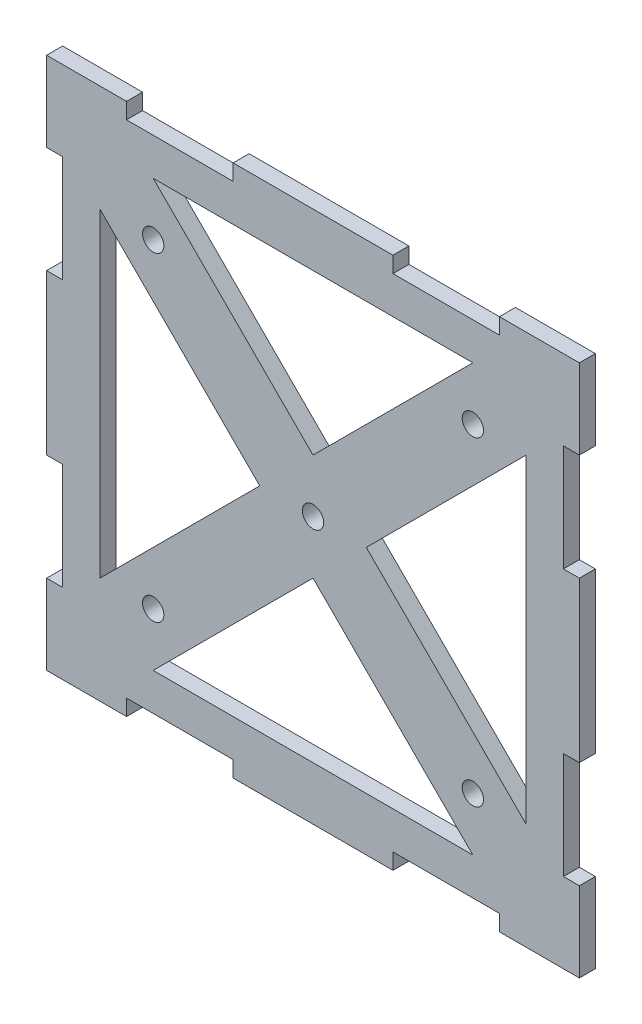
ISO-10303-21;
HEADER;
FILE_DESCRIPTION(('STEP AP214'),'2;1');
FILE_NAME('part.step','',(''),(''),'','','');
FILE_SCHEMA(('AUTOMOTIVE_DESIGN { 1 0 10303 214 1 1 1 1 }'));
ENDSEC;
DATA;
#1=APPLICATION_CONTEXT('core data for automotive mechanical design processes');
#2=APPLICATION_PROTOCOL_DEFINITION('international standard','automotive_design',2000,#1);
#3=PRODUCT_CONTEXT('',#1,'mechanical');
#4=PRODUCT('Part','Part','',(#3));
#5=PRODUCT_RELATED_PRODUCT_CATEGORY('part','',(#4));
#6=PRODUCT_DEFINITION_FORMATION('','',#4);
#7=PRODUCT_DEFINITION_CONTEXT('part definition',#1,'design');
#8=PRODUCT_DEFINITION('design','',#6,#7);
#9=PRODUCT_DEFINITION_SHAPE('','',#8);
#10=(LENGTH_UNIT() NAMED_UNIT(*) SI_UNIT(.MILLI.,.METRE.));
#11=(NAMED_UNIT(*) PLANE_ANGLE_UNIT() SI_UNIT($,.RADIAN.));
#12=(NAMED_UNIT(*) SI_UNIT($,.STERADIAN.) SOLID_ANGLE_UNIT());
#13=UNCERTAINTY_MEASURE_WITH_UNIT(LENGTH_MEASURE(1.E-05),#10,'distance_accuracy_value','');
#14=(GEOMETRIC_REPRESENTATION_CONTEXT(3) GLOBAL_UNCERTAINTY_ASSIGNED_CONTEXT((#13)) GLOBAL_UNIT_ASSIGNED_CONTEXT((#10,
#11,#12)) REPRESENTATION_CONTEXT('',''));
#15=CARTESIAN_POINT('',(0.,0.,0.));
#16=DIRECTION('',(0.,0.,1.));
#17=DIRECTION('',(1.,0.,0.));
#18=AXIS2_PLACEMENT_3D('',#15,#16,#17);
#19=CARTESIAN_POINT('',(13.6485566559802,0.,3.));
#20=DIRECTION('',(1.,0.,0.));
#21=DIRECTION('',(0.,1.,0.));
#22=AXIS2_PLACEMENT_3D('',#19,#20,#21);
#23=PLANE('',#22);
#24=DIRECTION('',(0.,0.,1.));
#25=VECTOR('',#24,1.);
#26=CARTESIAN_POINT('',(13.6485566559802,18.4274540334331,-0.00100000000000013));
#27=LINE('',#26,#25);
#28=CARTESIAN_POINT('',(13.6485566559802,18.4274540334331,0.));
#29=VERTEX_POINT('',#28);
#30=CARTESIAN_POINT('',(13.6485566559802,18.4274540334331,3.));
#31=VERTEX_POINT('',#30);
#32=EDGE_CURVE('E533',#29,#31,#27,.T.);
#33=ORIENTED_EDGE('',*,*,#32,.T.);
#34=DIRECTION('',(0.,-1.,0.));
#35=VECTOR('',#34,1.);
#36=CARTESIAN_POINT('',(13.6485566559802,0.,3.));
#37=LINE('',#36,#35);
#38=CARTESIAN_POINT('',(13.6485566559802,3.42745403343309,3.));
#39=VERTEX_POINT('',#38);
#40=EDGE_CURVE('E500',#31,#39,#37,.T.);
#41=ORIENTED_EDGE('',*,*,#40,.T.);
#42=DIRECTION('',(0.,0.,-1.));
#43=VECTOR('',#42,1.);
#44=CARTESIAN_POINT('',(13.6485566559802,3.42745403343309,3.));
#45=LINE('',#44,#43);
#46=CARTESIAN_POINT('',(13.6485566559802,3.42745403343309,0.));
#47=VERTEX_POINT('',#46);
#48=EDGE_CURVE('E393',#39,#47,#45,.T.);
#49=ORIENTED_EDGE('',*,*,#48,.T.);
#50=DIRECTION('',(0.,-1.,0.));
#51=VECTOR('',#50,1.);
#52=CARTESIAN_POINT('',(13.6485566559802,0.,0.));
#53=LINE('',#52,#51);
#54=EDGE_CURVE('E479',#29,#47,#53,.T.);
#55=ORIENTED_EDGE('',*,*,#54,.F.);
#56=EDGE_LOOP('',(#33,#41,#49,#55));
#57=FACE_BOUND('',#56,.T.);
#58=ADVANCED_FACE('F33',(#57),#23,.T.);
#59=DIRECTION('',(0.,0.,1.));
#60=VECTOR('',#59,1.);
#61=CARTESIAN_POINT('',(13.6485566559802,88.4274540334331,-0.00100000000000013));
#62=LINE('',#61,#60);
#63=CARTESIAN_POINT('',(13.6485566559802,88.4274540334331,0.));
#64=VERTEX_POINT('',#63);
#65=CARTESIAN_POINT('',(13.6485566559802,88.4274540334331,3.));
#66=VERTEX_POINT('',#65);
#67=EDGE_CURVE('E586',#64,#66,#62,.T.);
#68=ORIENTED_EDGE('',*,*,#67,.F.);
#69=CARTESIAN_POINT('',(13.6485566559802,103.427454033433,0.));
#70=VERTEX_POINT('',#69);
#71=EDGE_CURVE('E480',#70,#64,#53,.T.);
#72=ORIENTED_EDGE('',*,*,#71,.F.);
#73=DIRECTION('',(0.,0.,-1.));
#74=VECTOR('',#73,1.);
#75=CARTESIAN_POINT('',(13.6485566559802,103.427454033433,3.));
#76=LINE('',#75,#74);
#77=CARTESIAN_POINT('',(13.6485566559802,103.427454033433,3.));
#78=VERTEX_POINT('',#77);
#79=EDGE_CURVE('E11',#78,#70,#76,.T.);
#80=ORIENTED_EDGE('',*,*,#79,.F.);
#81=EDGE_CURVE('E666',#78,#66,#37,.T.);
#82=ORIENTED_EDGE('',*,*,#81,.T.);
#83=EDGE_LOOP('',(#68,#72,#80,#82));
#84=FACE_BOUND('',#83,.T.);
#85=ADVANCED_FACE('F717',(#84),#23,.T.);
#86=CARTESIAN_POINT('',(0.,103.427454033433,3.));
#87=DIRECTION('',(0.,1.,0.));
#88=DIRECTION('',(0.,0.,1.));
#89=AXIS2_PLACEMENT_3D('',#86,#87,#88);
#90=PLANE('',#89);
#91=DIRECTION('',(0.,0.,1.));
#92=VECTOR('',#91,1.);
#93=CARTESIAN_POINT('',(-1.35144334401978,103.427454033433,-0.00100000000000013));
#94=LINE('',#93,#92);
#95=CARTESIAN_POINT('',(-1.35144334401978,103.427454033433,0.));
#96=VERTEX_POINT('',#95);
#97=CARTESIAN_POINT('',(-1.35144334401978,103.427454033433,3.));
#98=VERTEX_POINT('',#97);
#99=EDGE_CURVE('E610',#96,#98,#94,.T.);
#100=ORIENTED_EDGE('',*,*,#99,.T.);
#101=DIRECTION('',(1.,0.,0.));
#102=VECTOR('',#101,1.);
#103=CARTESIAN_POINT('',(0.,103.427454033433,3.));
#104=LINE('',#103,#102);
#105=EDGE_CURVE('E669',#98,#78,#104,.T.);
#106=ORIENTED_EDGE('',*,*,#105,.T.);
#107=ORIENTED_EDGE('',*,*,#79,.T.);
#108=DIRECTION('',(1.,0.,0.));
#109=VECTOR('',#108,1.);
#110=CARTESIAN_POINT('',(0.,103.427454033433,0.));
#111=LINE('',#110,#109);
#112=EDGE_CURVE('E482',#96,#70,#111,.T.);
#113=ORIENTED_EDGE('',*,*,#112,.F.);
#114=EDGE_LOOP('',(#100,#106,#107,#113));
#115=FACE_BOUND('',#114,.T.);
#116=ADVANCED_FACE('F723',(#115),#90,.T.);
#117=CARTESIAN_POINT('',(-86.3514433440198,0.,3.));
#118=DIRECTION('',(1.,0.,0.));
#119=DIRECTION('',(0.,1.,0.));
#120=AXIS2_PLACEMENT_3D('',#117,#118,#119);
#121=PLANE('',#120);
#122=DIRECTION('',(0.,-1.,0.));
#123=VECTOR('',#122,1.);
#124=CARTESIAN_POINT('',(-86.3514433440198,0.,0.));
#125=LINE('',#124,#123);
#126=CARTESIAN_POINT('',(-86.3514433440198,103.427454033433,0.));
#127=VERTEX_POINT('',#126);
#128=CARTESIAN_POINT('',(-86.3514433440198,88.4274540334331,0.));
#129=VERTEX_POINT('',#128);
#130=EDGE_CURVE('E364',#127,#129,#125,.T.);
#131=ORIENTED_EDGE('',*,*,#130,.T.);
#132=DIRECTION('',(0.,0.,1.));
#133=VECTOR('',#132,1.);
#134=CARTESIAN_POINT('',(-86.3514433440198,88.4274540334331,-0.00100000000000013));
#135=LINE('',#134,#133);
#136=CARTESIAN_POINT('',(-86.3514433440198,88.4274540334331,3.));
#137=VERTEX_POINT('',#136);
#138=EDGE_CURVE('E349',#129,#137,#135,.T.);
#139=ORIENTED_EDGE('',*,*,#138,.T.);
#140=DIRECTION('',(0.,-1.,0.));
#141=VECTOR('',#140,1.);
#142=CARTESIAN_POINT('',(-86.3514433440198,0.,3.));
#143=LINE('',#142,#141);
#144=CARTESIAN_POINT('',(-86.3514433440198,103.427454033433,3.));
#145=VERTEX_POINT('',#144);
#146=EDGE_CURVE('E676',#145,#137,#143,.T.);
#147=ORIENTED_EDGE('',*,*,#146,.F.);
#148=DIRECTION('',(0.,0.,-1.));
#149=VECTOR('',#148,1.);
#150=CARTESIAN_POINT('',(-86.3514433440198,103.427454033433,3.));
#151=LINE('',#150,#149);
#152=EDGE_CURVE('E42',#145,#127,#151,.T.);
#153=ORIENTED_EDGE('',*,*,#152,.T.);
#154=EDGE_LOOP('',(#131,#139,#147,#153));
#155=FACE_BOUND('',#154,.T.);
#156=ADVANCED_FACE('F927',(#155),#121,.F.);
#157=CARTESIAN_POINT('',(-86.3514433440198,18.4274540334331,3.));
#158=VERTEX_POINT('',#157);
#159=CARTESIAN_POINT('',(-86.3514433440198,3.42745403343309,3.));
#160=VERTEX_POINT('',#159);
#161=EDGE_CURVE('E674',#158,#160,#143,.T.);
#162=ORIENTED_EDGE('',*,*,#161,.F.);
#163=DIRECTION('',(0.,0.,1.));
#164=VECTOR('',#163,1.);
#165=CARTESIAN_POINT('',(-86.3514433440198,18.4274540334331,-0.00100000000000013));
#166=LINE('',#165,#164);
#167=CARTESIAN_POINT('',(-86.3514433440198,18.4274540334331,0.));
#168=VERTEX_POINT('',#167);
#169=EDGE_CURVE('E803',#168,#158,#166,.T.);
#170=ORIENTED_EDGE('',*,*,#169,.F.);
#171=CARTESIAN_POINT('',(-86.3514433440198,3.42745403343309,0.));
#172=VERTEX_POINT('',#171);
#173=EDGE_CURVE('E365',#168,#172,#125,.T.);
#174=ORIENTED_EDGE('',*,*,#173,.T.);
#175=DIRECTION('',(0.,0.,-1.));
#176=VECTOR('',#175,1.);
#177=CARTESIAN_POINT('',(-86.3514433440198,3.42745403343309,3.));
#178=LINE('',#177,#176);
#179=EDGE_CURVE('E396',#160,#172,#178,.T.);
#180=ORIENTED_EDGE('',*,*,#179,.F.);
#181=EDGE_LOOP('',(#162,#170,#174,#180));
#182=FACE_BOUND('',#181,.T.);
#183=ADVANCED_FACE('F824',(#182),#121,.F.);
#184=CARTESIAN_POINT('',(0.,3.42745403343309,3.));
#185=DIRECTION('',(0.,1.,0.));
#186=DIRECTION('',(0.,0.,1.));
#187=AXIS2_PLACEMENT_3D('',#184,#185,#186);
#188=PLANE('',#187);
#189=DIRECTION('',(1.,0.,0.));
#190=VECTOR('',#189,1.);
#191=CARTESIAN_POINT('',(0.,3.42745403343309,0.));
#192=LINE('',#191,#190);
#193=CARTESIAN_POINT('',(-71.3514433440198,3.4274540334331,0.));
#194=VERTEX_POINT('',#193);
#195=EDGE_CURVE('E373',#172,#194,#192,.T.);
#196=ORIENTED_EDGE('',*,*,#195,.T.);
#197=DIRECTION('',(0.,0.,1.));
#198=VECTOR('',#197,1.);
#199=CARTESIAN_POINT('',(-71.3514433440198,3.4274540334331,-0.00100000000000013));
#200=LINE('',#199,#198);
#201=CARTESIAN_POINT('',(-71.3514433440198,3.4274540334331,3.));
#202=VERTEX_POINT('',#201);
#203=EDGE_CURVE('E783',#194,#202,#200,.T.);
#204=ORIENTED_EDGE('',*,*,#203,.T.);
#205=DIRECTION('',(1.,0.,0.));
#206=VECTOR('',#205,1.);
#207=CARTESIAN_POINT('',(0.,3.42745403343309,3.));
#208=LINE('',#207,#206);
#209=EDGE_CURVE('E679',#160,#202,#208,.T.);
#210=ORIENTED_EDGE('',*,*,#209,.F.);
#211=ORIENTED_EDGE('',*,*,#179,.T.);
#212=EDGE_LOOP('',(#196,#204,#210,#211));
#213=FACE_BOUND('',#212,.T.);
#214=ADVANCED_FACE('F819',(#213),#188,.F.);
#215=CARTESIAN_POINT('',(-1.35144334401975,3.4274540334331,3.));
#216=VERTEX_POINT('',#215);
#217=EDGE_CURVE('E506',#216,#39,#208,.T.);
#218=ORIENTED_EDGE('',*,*,#217,.F.);
#219=DIRECTION('',(0.,0.,1.));
#220=VECTOR('',#219,1.);
#221=CARTESIAN_POINT('',(-1.35144334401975,3.4274540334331,-0.00100000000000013));
#222=LINE('',#221,#220);
#223=CARTESIAN_POINT('',(-1.35144334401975,3.4274540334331,0.));
#224=VERTEX_POINT('',#223);
#225=EDGE_CURVE('E507',#224,#216,#222,.T.);
#226=ORIENTED_EDGE('',*,*,#225,.F.);
#227=EDGE_CURVE('E368',#224,#47,#192,.T.);
#228=ORIENTED_EDGE('',*,*,#227,.T.);
#229=ORIENTED_EDGE('',*,*,#48,.F.);
#230=EDGE_LOOP('',(#218,#226,#228,#229));
#231=FACE_BOUND('',#230,.T.);
#232=ADVANCED_FACE('F504',(#231),#188,.F.);
#233=DIRECTION('',(0.,0.,1.));
#234=VECTOR('',#233,1.);
#235=CARTESIAN_POINT('',(-71.3514433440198,103.427454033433,-0.00100000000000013));
#236=LINE('',#235,#234);
#237=CARTESIAN_POINT('',(-71.3514433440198,103.427454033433,0.));
#238=VERTEX_POINT('',#237);
#239=CARTESIAN_POINT('',(-71.3514433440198,103.427454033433,3.));
#240=VERTEX_POINT('',#239);
#241=EDGE_CURVE('E447',#238,#240,#236,.T.);
#242=ORIENTED_EDGE('',*,*,#241,.F.);
#243=EDGE_CURVE('E369',#127,#238,#111,.T.);
#244=ORIENTED_EDGE('',*,*,#243,.F.);
#245=ORIENTED_EDGE('',*,*,#152,.F.);
#246=EDGE_CURVE('E671',#145,#240,#104,.T.);
#247=ORIENTED_EDGE('',*,*,#246,.T.);
#248=EDGE_LOOP('',(#242,#244,#245,#247));
#249=FACE_BOUND('',#248,.T.);
#250=ADVANCED_FACE('F729',(#249),#90,.T.);
#251=DIRECTION('',(0.,0.,1.));
#252=VECTOR('',#251,1.);
#253=CARTESIAN_POINT('',(13.6485566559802,38.4274540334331,-0.00100000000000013));
#254=LINE('',#253,#252);
#255=CARTESIAN_POINT('',(13.6485566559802,38.4274540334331,0.));
#256=VERTEX_POINT('',#255);
#257=CARTESIAN_POINT('',(13.6485566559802,38.4274540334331,3.));
#258=VERTEX_POINT('',#257);
#259=EDGE_CURVE('E565',#256,#258,#254,.T.);
#260=ORIENTED_EDGE('',*,*,#259,.F.);
#261=CARTESIAN_POINT('',(13.6485566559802,68.4274540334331,0.));
#262=VERTEX_POINT('',#261);
#263=EDGE_CURVE('E483',#262,#256,#53,.T.);
#264=ORIENTED_EDGE('',*,*,#263,.F.);
#265=DIRECTION('',(0.,0.,1.));
#266=VECTOR('',#265,1.);
#267=CARTESIAN_POINT('',(13.6485566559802,68.4274540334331,-0.00100000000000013));
#268=LINE('',#267,#266);
#269=CARTESIAN_POINT('',(13.6485566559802,68.4274540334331,3.));
#270=VERTEX_POINT('',#269);
#271=EDGE_CURVE('E588',#262,#270,#268,.T.);
#272=ORIENTED_EDGE('',*,*,#271,.T.);
#273=EDGE_CURVE('E670',#270,#258,#37,.T.);
#274=ORIENTED_EDGE('',*,*,#273,.T.);
#275=EDGE_LOOP('',(#260,#264,#272,#274));
#276=FACE_BOUND('',#275,.T.);
#277=ADVANCED_FACE('F719',(#276),#23,.T.);
#278=DIRECTION('',(0.,0.,1.));
#279=VECTOR('',#278,1.);
#280=CARTESIAN_POINT('',(-21.3514433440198,103.427454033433,-0.00100000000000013));
#281=LINE('',#280,#279);
#282=CARTESIAN_POINT('',(-21.3514433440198,103.427454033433,0.));
#283=VERTEX_POINT('',#282);
#284=CARTESIAN_POINT('',(-21.3514433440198,103.427454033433,3.));
#285=VERTEX_POINT('',#284);
#286=EDGE_CURVE('E609',#283,#285,#281,.T.);
#287=ORIENTED_EDGE('',*,*,#286,.F.);
#288=CARTESIAN_POINT('',(-51.3514433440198,103.427454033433,0.));
#289=VERTEX_POINT('',#288);
#290=EDGE_CURVE('E486',#289,#283,#111,.T.);
#291=ORIENTED_EDGE('',*,*,#290,.F.);
#292=DIRECTION('',(0.,0.,1.));
#293=VECTOR('',#292,1.);
#294=CARTESIAN_POINT('',(-51.3514433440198,103.427454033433,-0.00100000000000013));
#295=LINE('',#294,#293);
#296=CARTESIAN_POINT('',(-51.3514433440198,103.427454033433,3.));
#297=VERTEX_POINT('',#296);
#298=EDGE_CURVE('E632',#289,#297,#295,.T.);
#299=ORIENTED_EDGE('',*,*,#298,.T.);
#300=EDGE_CURVE('E675',#297,#285,#104,.T.);
#301=ORIENTED_EDGE('',*,*,#300,.T.);
#302=EDGE_LOOP('',(#287,#291,#299,#301));
#303=FACE_BOUND('',#302,.T.);
#304=ADVANCED_FACE('F728',(#303),#90,.T.);
#305=CARTESIAN_POINT('',(-86.3514433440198,68.4274540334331,3.));
#306=VERTEX_POINT('',#305);
#307=CARTESIAN_POINT('',(-86.3514433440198,38.4274540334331,3.));
#308=VERTEX_POINT('',#307);
#309=EDGE_CURVE('E358',#306,#308,#143,.T.);
#310=ORIENTED_EDGE('',*,*,#309,.F.);
#311=DIRECTION('',(0.,0.,1.));
#312=VECTOR('',#311,1.);
#313=CARTESIAN_POINT('',(-86.3514433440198,68.4274540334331,-0.00100000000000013));
#314=LINE('',#313,#312);
#315=CARTESIAN_POINT('',(-86.3514433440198,68.4274540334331,0.));
#316=VERTEX_POINT('',#315);
#317=EDGE_CURVE('E343',#316,#306,#314,.T.);
#318=ORIENTED_EDGE('',*,*,#317,.F.);
#319=CARTESIAN_POINT('',(-86.3514433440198,38.4274540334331,0.));
#320=VERTEX_POINT('',#319);
#321=EDGE_CURVE('E356',#316,#320,#125,.T.);
#322=ORIENTED_EDGE('',*,*,#321,.T.);
#323=DIRECTION('',(0.,0.,1.));
#324=VECTOR('',#323,1.);
#325=CARTESIAN_POINT('',(-86.3514433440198,38.4274540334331,-0.00100000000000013));
#326=LINE('',#325,#324);
#327=EDGE_CURVE('E806',#320,#308,#326,.T.);
#328=ORIENTED_EDGE('',*,*,#327,.T.);
#329=EDGE_LOOP('',(#310,#318,#322,#328));
#330=FACE_BOUND('',#329,.T.);
#331=ADVANCED_FACE('F354',(#330),#121,.F.);
#332=CARTESIAN_POINT('',(-76.3514433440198,0.,3.));
#333=DIRECTION('',(1.,0.,0.));
#334=DIRECTION('',(0.,1.,0.));
#335=AXIS2_PLACEMENT_3D('',#332,#333,#334);
#336=PLANE('',#335);
#337=DIRECTION('',(0.,-1.,0.));
#338=VECTOR('',#337,1.);
#339=CARTESIAN_POINT('',(-76.3514433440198,0.,0.));
#340=LINE('',#339,#338);
#341=CARTESIAN_POINT('',(-76.3514433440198,83.4274540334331,0.));
#342=VERTEX_POINT('',#341);
#343=CARTESIAN_POINT('',(-76.3514433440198,23.4274540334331,0.));
#344=VERTEX_POINT('',#343);
#345=EDGE_CURVE('E471',#342,#344,#340,.T.);
#346=ORIENTED_EDGE('',*,*,#345,.F.);
#347=DIRECTION('',(0.,0.,-1.));
#348=VECTOR('',#347,1.);
#349=CARTESIAN_POINT('',(-76.3514433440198,83.4274540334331,3.));
#350=LINE('',#349,#348);
#351=CARTESIAN_POINT('',(-76.3514433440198,83.4274540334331,3.));
#352=VERTEX_POINT('',#351);
#353=EDGE_CURVE('E397',#352,#342,#350,.T.);
#354=ORIENTED_EDGE('',*,*,#353,.F.);
#355=DIRECTION('',(0.,-1.,0.));
#356=VECTOR('',#355,1.);
#357=CARTESIAN_POINT('',(-76.3514433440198,0.,3.));
#358=LINE('',#357,#356);
#359=CARTESIAN_POINT('',(-76.3514433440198,23.4274540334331,3.));
#360=VERTEX_POINT('',#359);
#361=EDGE_CURVE('E658',#352,#360,#358,.T.);
#362=ORIENTED_EDGE('',*,*,#361,.T.);
#363=DIRECTION('',(0.,0.,-1.));
#364=VECTOR('',#363,1.);
#365=CARTESIAN_POINT('',(-76.3514433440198,23.4274540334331,3.));
#366=LINE('',#365,#364);
#367=EDGE_CURVE('E401',#360,#344,#366,.T.);
#368=ORIENTED_EDGE('',*,*,#367,.T.);
#369=EDGE_LOOP('',(#346,#354,#362,#368));
#370=FACE_BOUND('',#369,.T.);
#371=ADVANCED_FACE('F935',(#370),#336,.T.);
#372=CARTESIAN_POINT('',(3.53800534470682,3.53800534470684,3.));
#373=DIRECTION('',(0.707106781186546,0.707106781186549,0.));
#374=DIRECTION('',(-0.707106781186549,0.707106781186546,0.));
#375=AXIS2_PLACEMENT_3D('',#372,#373,#374);
#376=PLANE('',#375);
#377=DIRECTION('',(0.707106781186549,-0.707106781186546,0.));
#378=VECTOR('',#377,1.);
#379=CARTESIAN_POINT('',(3.53800534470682,3.53800534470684,0.));
#380=LINE('',#379,#378);
#381=CARTESIAN_POINT('',(-46.3514433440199,53.4274540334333,0.));
#382=VERTEX_POINT('',#381);
#383=EDGE_CURVE('E474',#342,#382,#380,.T.);
#384=ORIENTED_EDGE('',*,*,#383,.T.);
#385=DIRECTION('',(0.,0.,-1.));
#386=VECTOR('',#385,1.);
#387=CARTESIAN_POINT('',(-46.3514433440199,53.4274540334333,3.));
#388=LINE('',#387,#386);
#389=CARTESIAN_POINT('',(-46.3514433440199,53.4274540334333,3.));
#390=VERTEX_POINT('',#389);
#391=EDGE_CURVE('E403',#390,#382,#388,.T.);
#392=ORIENTED_EDGE('',*,*,#391,.F.);
#393=DIRECTION('',(0.707106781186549,-0.707106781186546,0.));
#394=VECTOR('',#393,1.);
#395=CARTESIAN_POINT('',(3.53800534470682,3.53800534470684,3.));
#396=LINE('',#395,#394);
#397=EDGE_CURVE('E661',#352,#390,#396,.T.);
#398=ORIENTED_EDGE('',*,*,#397,.F.);
#399=ORIENTED_EDGE('',*,*,#353,.T.);
#400=EDGE_LOOP('',(#384,#392,#398,#399));
#401=FACE_BOUND('',#400,.T.);
#402=ADVANCED_FACE('F984',(#401),#376,.F.);
#403=CARTESIAN_POINT('',(0.,13.4274540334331,3.));
#404=DIRECTION('',(0.,1.,0.));
#405=DIRECTION('',(-1.,0.,0.));
#406=AXIS2_PLACEMENT_3D('',#403,#404,#405);
#407=PLANE('',#406);
#408=DIRECTION('',(1.,0.,0.));
#409=VECTOR('',#408,1.);
#410=CARTESIAN_POINT('',(0.,13.4274540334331,0.));
#411=LINE('',#410,#409);
#412=CARTESIAN_POINT('',(-66.3514433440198,13.4274540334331,0.));
#413=VERTEX_POINT('',#412);
#414=CARTESIAN_POINT('',(-6.35144334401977,13.4274540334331,0.));
#415=VERTEX_POINT('',#414);
#416=EDGE_CURVE('E462',#413,#415,#411,.T.);
#417=ORIENTED_EDGE('',*,*,#416,.F.);
#418=DIRECTION('',(0.,0.,-1.));
#419=VECTOR('',#418,1.);
#420=CARTESIAN_POINT('',(-66.3514433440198,13.4274540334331,3.));
#421=LINE('',#420,#419);
#422=CARTESIAN_POINT('',(-66.3514433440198,13.4274540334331,3.));
#423=VERTEX_POINT('',#422);
#424=EDGE_CURVE('E404',#423,#413,#421,.T.);
#425=ORIENTED_EDGE('',*,*,#424,.F.);
#426=DIRECTION('',(1.,0.,0.));
#427=VECTOR('',#426,1.);
#428=CARTESIAN_POINT('',(0.,13.4274540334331,3.));
#429=LINE('',#428,#427);
#430=CARTESIAN_POINT('',(-6.35144334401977,13.4274540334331,3.));
#431=VERTEX_POINT('',#430);
#432=EDGE_CURVE('E650',#423,#431,#429,.T.);
#433=ORIENTED_EDGE('',*,*,#432,.T.);
#434=DIRECTION('',(0.,0.,-1.));
#435=VECTOR('',#434,1.);
#436=CARTESIAN_POINT('',(-6.35144334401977,13.4274540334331,3.));
#437=LINE('',#436,#435);
#438=EDGE_CURVE('E407',#431,#415,#437,.T.);
#439=ORIENTED_EDGE('',*,*,#438,.T.);
#440=EDGE_LOOP('',(#417,#425,#433,#439));
#441=FACE_BOUND('',#440,.T.);
#442=ADVANCED_FACE('F981',(#441),#407,.T.);
#443=CARTESIAN_POINT('',(-39.8894486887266,39.8894486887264,3.));
#444=DIRECTION('',(-0.707106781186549,0.707106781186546,0.));
#445=DIRECTION('',(-0.707106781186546,-0.707106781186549,0.));
#446=AXIS2_PLACEMENT_3D('',#443,#444,#445);
#447=PLANE('',#446);
#448=DIRECTION('',(0.707106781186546,0.707106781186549,0.));
#449=VECTOR('',#448,1.);
#450=CARTESIAN_POINT('',(-39.8894486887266,39.8894486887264,0.));
#451=LINE('',#450,#449);
#452=CARTESIAN_POINT('',(-36.3514433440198,43.4274540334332,0.));
#453=VERTEX_POINT('',#452);
#454=EDGE_CURVE('E465',#413,#453,#451,.T.);
#455=ORIENTED_EDGE('',*,*,#454,.T.);
#456=DIRECTION('',(0.,0.,-1.));
#457=VECTOR('',#456,1.);
#458=CARTESIAN_POINT('',(-36.3514433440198,43.4274540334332,3.));
#459=LINE('',#458,#457);
#460=CARTESIAN_POINT('',(-36.3514433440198,43.4274540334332,3.));
#461=VERTEX_POINT('',#460);
#462=EDGE_CURVE('E409',#461,#453,#459,.T.);
#463=ORIENTED_EDGE('',*,*,#462,.F.);
#464=DIRECTION('',(0.707106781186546,0.707106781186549,0.));
#465=VECTOR('',#464,1.);
#466=CARTESIAN_POINT('',(-39.8894486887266,39.8894486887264,3.));
#467=LINE('',#466,#465);
#468=EDGE_CURVE('E653',#423,#461,#467,.T.);
#469=ORIENTED_EDGE('',*,*,#468,.F.);
#470=ORIENTED_EDGE('',*,*,#424,.T.);
#471=EDGE_LOOP('',(#455,#463,#469,#470));
#472=FACE_BOUND('',#471,.T.);
#473=ADVANCED_FACE('F972',(#472),#447,.F.);
#474=CARTESIAN_POINT('',(-39.8894486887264,39.8894486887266,3.));
#475=DIRECTION('',(0.707106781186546,-0.707106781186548,0.));
#476=DIRECTION('',(0.707106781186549,0.707106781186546,0.));
#477=AXIS2_PLACEMENT_3D('',#474,#475,#476);
#478=PLANE('',#477);
#479=DIRECTION('',(-0.707106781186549,-0.707106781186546,0.));
#480=VECTOR('',#479,1.);
#481=CARTESIAN_POINT('',(-39.8894486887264,39.8894486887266,0.));
#482=LINE('',#481,#480);
#483=CARTESIAN_POINT('',(3.64855665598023,83.4274540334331,0.));
#484=VERTEX_POINT('',#483);
#485=CARTESIAN_POINT('',(-26.3514433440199,53.4274540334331,0.));
#486=VERTEX_POINT('',#485);
#487=EDGE_CURVE('E453',#484,#486,#482,.T.);
#488=ORIENTED_EDGE('',*,*,#487,.F.);
#489=DIRECTION('',(0.,0.,-1.));
#490=VECTOR('',#489,1.);
#491=CARTESIAN_POINT('',(3.64855665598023,83.4274540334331,3.));
#492=LINE('',#491,#490);
#493=CARTESIAN_POINT('',(3.64855665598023,83.4274540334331,3.));
#494=VERTEX_POINT('',#493);
#495=EDGE_CURVE('E410',#494,#484,#492,.T.);
#496=ORIENTED_EDGE('',*,*,#495,.F.);
#497=DIRECTION('',(-0.707106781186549,-0.707106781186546,0.));
#498=VECTOR('',#497,1.);
#499=CARTESIAN_POINT('',(-39.8894486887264,39.8894486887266,3.));
#500=LINE('',#499,#498);
#501=CARTESIAN_POINT('',(-26.3514433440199,53.4274540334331,3.));
#502=VERTEX_POINT('',#501);
#503=EDGE_CURVE('E642',#494,#502,#500,.T.);
#504=ORIENTED_EDGE('',*,*,#503,.T.);
#505=DIRECTION('',(0.,0.,-1.));
#506=VECTOR('',#505,1.);
#507=CARTESIAN_POINT('',(-26.3514433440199,53.4274540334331,3.));
#508=LINE('',#507,#506);
#509=EDGE_CURVE('E414',#502,#486,#508,.T.);
#510=ORIENTED_EDGE('',*,*,#509,.T.);
#511=EDGE_LOOP('',(#488,#496,#504,#510));
#512=FACE_BOUND('',#511,.T.);
#513=ADVANCED_FACE('F969',(#512),#478,.T.);
#514=CARTESIAN_POINT('',(3.64855665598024,0.,3.));
#515=DIRECTION('',(1.,0.,0.));
#516=DIRECTION('',(0.,1.,0.));
#517=AXIS2_PLACEMENT_3D('',#514,#515,#516);
#518=PLANE('',#517);
#519=DIRECTION('',(0.,-1.,0.));
#520=VECTOR('',#519,1.);
#521=CARTESIAN_POINT('',(3.64855665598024,0.,0.));
#522=LINE('',#521,#520);
#523=CARTESIAN_POINT('',(3.64855665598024,23.4274540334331,0.));
#524=VERTEX_POINT('',#523);
#525=EDGE_CURVE('E456',#484,#524,#522,.T.);
#526=ORIENTED_EDGE('',*,*,#525,.T.);
#527=DIRECTION('',(0.,0.,-1.));
#528=VECTOR('',#527,1.);
#529=CARTESIAN_POINT('',(3.64855665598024,23.4274540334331,3.));
#530=LINE('',#529,#528);
#531=CARTESIAN_POINT('',(3.64855665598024,23.4274540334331,3.));
#532=VERTEX_POINT('',#531);
#533=EDGE_CURVE('E416',#532,#524,#530,.T.);
#534=ORIENTED_EDGE('',*,*,#533,.F.);
#535=DIRECTION('',(0.,-1.,0.));
#536=VECTOR('',#535,1.);
#537=CARTESIAN_POINT('',(3.64855665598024,0.,3.));
#538=LINE('',#537,#536);
#539=EDGE_CURVE('E645',#494,#532,#538,.T.);
#540=ORIENTED_EDGE('',*,*,#539,.F.);
#541=ORIENTED_EDGE('',*,*,#495,.T.);
#542=EDGE_LOOP('',(#526,#534,#540,#541));
#543=FACE_BOUND('',#542,.T.);
#544=ADVANCED_FACE('F964',(#543),#518,.F.);
#545=CARTESIAN_POINT('',(13.5380053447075,13.5380053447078,3.));
#546=DIRECTION('',(0.707106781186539,0.707106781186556,0.));
#547=DIRECTION('',(-0.707106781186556,0.707106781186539,0.));
#548=AXIS2_PLACEMENT_3D('',#545,#546,#547);
#549=PLANE('',#548);
#550=DIRECTION('',(0.707106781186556,-0.707106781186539,0.));
#551=VECTOR('',#550,1.);
#552=CARTESIAN_POINT('',(13.5380053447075,13.5380053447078,0.));
#553=LINE('',#552,#551);
#554=CARTESIAN_POINT('',(-66.3514433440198,93.4274540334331,0.));
#555=VERTEX_POINT('',#554);
#556=CARTESIAN_POINT('',(-36.3514433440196,63.4274540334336,0.));
#557=VERTEX_POINT('',#556);
#558=EDGE_CURVE('E440',#555,#557,#553,.T.);
#559=ORIENTED_EDGE('',*,*,#558,.F.);
#560=DIRECTION('',(0.,0.,-1.));
#561=VECTOR('',#560,1.);
#562=CARTESIAN_POINT('',(-66.3514433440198,93.4274540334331,3.));
#563=LINE('',#562,#561);
#564=CARTESIAN_POINT('',(-66.3514433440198,93.4274540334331,3.));
#565=VERTEX_POINT('',#564);
#566=EDGE_CURVE('E37',#565,#555,#563,.T.);
#567=ORIENTED_EDGE('',*,*,#566,.F.);
#568=DIRECTION('',(0.707106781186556,-0.707106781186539,0.));
#569=VECTOR('',#568,1.);
#570=CARTESIAN_POINT('',(13.5380053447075,13.5380053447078,3.));
#571=LINE('',#570,#569);
#572=CARTESIAN_POINT('',(-36.3514433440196,63.4274540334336,3.));
#573=VERTEX_POINT('',#572);
#574=EDGE_CURVE('E392',#565,#573,#571,.T.);
#575=ORIENTED_EDGE('',*,*,#574,.T.);
#576=DIRECTION('',(0.,0.,-1.));
#577=VECTOR('',#576,1.);
#578=CARTESIAN_POINT('',(-36.3514433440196,63.4274540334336,3.));
#579=LINE('',#578,#577);
#580=EDGE_CURVE('E419',#573,#557,#579,.T.);
#581=ORIENTED_EDGE('',*,*,#580,.T.);
#582=EDGE_LOOP('',(#559,#567,#575,#581));
#583=FACE_BOUND('',#582,.T.);
#584=ADVANCED_FACE('F35',(#583),#549,.T.);
#585=CARTESIAN_POINT('',(0.,93.4274540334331,3.));
#586=DIRECTION('',(0.,1.,0.));
#587=DIRECTION('',(0.,0.,1.));
#588=AXIS2_PLACEMENT_3D('',#585,#586,#587);
#589=PLANE('',#588);
#590=DIRECTION('',(1.,0.,0.));
#591=VECTOR('',#590,1.);
#592=CARTESIAN_POINT('',(0.,93.4274540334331,0.));
#593=LINE('',#592,#591);
#594=CARTESIAN_POINT('',(-6.35144334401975,93.4274540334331,0.));
#595=VERTEX_POINT('',#594);
#596=EDGE_CURVE('E432',#555,#595,#593,.T.);
#597=ORIENTED_EDGE('',*,*,#596,.T.);
#598=DIRECTION('',(0.,0.,-1.));
#599=VECTOR('',#598,1.);
#600=CARTESIAN_POINT('',(-6.35144334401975,93.4274540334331,3.));
#601=LINE('',#600,#599);
#602=CARTESIAN_POINT('',(-6.35144334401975,93.4274540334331,3.));
#603=VERTEX_POINT('',#602);
#604=EDGE_CURVE('E420',#603,#595,#601,.T.);
#605=ORIENTED_EDGE('',*,*,#604,.F.);
#606=DIRECTION('',(1.,0.,0.));
#607=VECTOR('',#606,1.);
#608=CARTESIAN_POINT('',(0.,93.4274540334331,3.));
#609=LINE('',#608,#607);
#610=EDGE_CURVE('E433',#565,#603,#609,.T.);
#611=ORIENTED_EDGE('',*,*,#610,.F.);
#612=ORIENTED_EDGE('',*,*,#566,.T.);
#613=EDGE_LOOP('',(#597,#605,#611,#612));
#614=FACE_BOUND('',#613,.T.);
#615=ADVANCED_FACE('F431',(#614),#589,.F.);
#616=CARTESIAN_POINT('',(-66.3514433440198,83.4274540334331,3.));
#617=DIRECTION('',(0.,0.,-1.));
#618=DIRECTION('',(-1.,0.,0.));
#619=AXIS2_PLACEMENT_3D('',#616,#617,#618);
#620=CYLINDRICAL_SURFACE('',#619,2.);
#621=CARTESIAN_POINT('',(-66.3514433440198,83.4274540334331,3.));
#622=DIRECTION('',(0.,0.,1.));
#623=DIRECTION('',(1.,0.,0.));
#624=AXIS2_PLACEMENT_3D('',#621,#622,#623);
#625=CIRCLE('',#624,2.);
#626=CARTESIAN_POINT('',(-64.3514433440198,83.4274540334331,3.));
#627=VERTEX_POINT('',#626);
#628=EDGE_CURVE('E691',#627,#627,#625,.T.);
#629=ORIENTED_EDGE('',*,*,#628,.T.);
#630=EDGE_LOOP('',(#629));
#631=FACE_BOUND('',#630,.T.);
#632=CARTESIAN_POINT('',(-66.3514433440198,83.4274540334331,0.));
#633=DIRECTION('',(0.,0.,1.));
#634=DIRECTION('',(1.,0.,0.));
#635=AXIS2_PLACEMENT_3D('',#632,#633,#634);
#636=CIRCLE('',#635,2.);
#637=CARTESIAN_POINT('',(-64.3514433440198,83.4274540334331,0.));
#638=VERTEX_POINT('',#637);
#639=EDGE_CURVE('E386',#638,#638,#636,.T.);
#640=ORIENTED_EDGE('',*,*,#639,.F.);
#641=EDGE_LOOP('',(#640));
#642=FACE_BOUND('',#641,.T.);
#643=ADVANCED_FACE('F950',(#631,#642),#620,.F.);
#644=CARTESIAN_POINT('',(-6.35144334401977,83.4274540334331,3.));
#645=DIRECTION('',(0.,0.,-1.));
#646=DIRECTION('',(-1.,0.,0.));
#647=AXIS2_PLACEMENT_3D('',#644,#645,#646);
#648=CYLINDRICAL_SURFACE('',#647,2.);
#649=CARTESIAN_POINT('',(-6.35144334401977,83.4274540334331,3.));
#650=DIRECTION('',(0.,0.,1.));
#651=DIRECTION('',(1.,0.,0.));
#652=AXIS2_PLACEMENT_3D('',#649,#650,#651);
#653=CIRCLE('',#652,2.);
#654=CARTESIAN_POINT('',(-4.35144334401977,83.4274540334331,3.));
#655=VERTEX_POINT('',#654);
#656=EDGE_CURVE('E689',#655,#655,#653,.T.);
#657=ORIENTED_EDGE('',*,*,#656,.T.);
#658=EDGE_LOOP('',(#657));
#659=FACE_BOUND('',#658,.T.);
#660=CARTESIAN_POINT('',(-6.35144334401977,83.4274540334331,0.));
#661=DIRECTION('',(0.,0.,1.));
#662=DIRECTION('',(1.,0.,0.));
#663=AXIS2_PLACEMENT_3D('',#660,#661,#662);
#664=CIRCLE('',#663,2.);
#665=CARTESIAN_POINT('',(-4.35144334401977,83.4274540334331,0.));
#666=VERTEX_POINT('',#665);
#667=EDGE_CURVE('E383',#666,#666,#664,.T.);
#668=ORIENTED_EDGE('',*,*,#667,.F.);
#669=EDGE_LOOP('',(#668));
#670=FACE_BOUND('',#669,.T.);
#671=ADVANCED_FACE('F946',(#659,#670),#648,.F.);
#672=CARTESIAN_POINT('',(-6.35144334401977,23.4274540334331,3.));
#673=DIRECTION('',(0.,0.,-1.));
#674=DIRECTION('',(-1.,0.,0.));
#675=AXIS2_PLACEMENT_3D('',#672,#673,#674);
#676=CYLINDRICAL_SURFACE('',#675,2.);
#677=CARTESIAN_POINT('',(-6.35144334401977,23.4274540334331,3.));
#678=DIRECTION('',(0.,0.,1.));
#679=DIRECTION('',(1.,0.,0.));
#680=AXIS2_PLACEMENT_3D('',#677,#678,#679);
#681=CIRCLE('',#680,2.);
#682=CARTESIAN_POINT('',(-4.35144334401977,23.4274540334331,3.));
#683=VERTEX_POINT('',#682);
#684=EDGE_CURVE('E686',#683,#683,#681,.T.);
#685=ORIENTED_EDGE('',*,*,#684,.T.);
#686=EDGE_LOOP('',(#685));
#687=FACE_BOUND('',#686,.T.);
#688=CARTESIAN_POINT('',(-6.35144334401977,23.4274540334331,0.));
#689=DIRECTION('',(0.,0.,1.));
#690=DIRECTION('',(1.,0.,0.));
#691=AXIS2_PLACEMENT_3D('',#688,#689,#690);
#692=CIRCLE('',#691,2.);
#693=CARTESIAN_POINT('',(-4.35144334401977,23.4274540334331,0.));
#694=VERTEX_POINT('',#693);
#695=EDGE_CURVE('E380',#694,#694,#692,.T.);
#696=ORIENTED_EDGE('',*,*,#695,.F.);
#697=EDGE_LOOP('',(#696));
#698=FACE_BOUND('',#697,.T.);
#699=ADVANCED_FACE('F942',(#687,#698),#676,.F.);
#700=CARTESIAN_POINT('',(-66.3514433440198,23.4274540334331,3.));
#701=DIRECTION('',(0.,0.,-1.));
#702=DIRECTION('',(-1.,0.,0.));
#703=AXIS2_PLACEMENT_3D('',#700,#701,#702);
#704=CYLINDRICAL_SURFACE('',#703,2.);
#705=CARTESIAN_POINT('',(-66.3514433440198,23.4274540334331,3.));
#706=DIRECTION('',(0.,0.,1.));
#707=DIRECTION('',(1.,0.,0.));
#708=AXIS2_PLACEMENT_3D('',#705,#706,#707);
#709=CIRCLE('',#708,2.);
#710=CARTESIAN_POINT('',(-64.3514433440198,23.4274540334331,3.));
#711=VERTEX_POINT('',#710);
#712=EDGE_CURVE('E682',#711,#711,#709,.T.);
#713=ORIENTED_EDGE('',*,*,#712,.T.);
#714=EDGE_LOOP('',(#713));
#715=FACE_BOUND('',#714,.T.);
#716=CARTESIAN_POINT('',(-66.3514433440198,23.4274540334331,0.));
#717=DIRECTION('',(0.,0.,1.));
#718=DIRECTION('',(1.,0.,0.));
#719=AXIS2_PLACEMENT_3D('',#716,#717,#718);
#720=CIRCLE('',#719,2.);
#721=CARTESIAN_POINT('',(-64.3514433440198,23.4274540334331,0.));
#722=VERTEX_POINT('',#721);
#723=EDGE_CURVE('E376',#722,#722,#720,.T.);
#724=ORIENTED_EDGE('',*,*,#723,.F.);
#725=EDGE_LOOP('',(#724));
#726=FACE_BOUND('',#725,.T.);
#727=ADVANCED_FACE('F939',(#715,#726),#704,.F.);
#728=CARTESIAN_POINT('',(-51.3514433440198,3.4274540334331,3.));
#729=VERTEX_POINT('',#728);
#730=CARTESIAN_POINT('',(-21.3514433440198,3.4274540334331,3.));
#731=VERTEX_POINT('',#730);
#732=EDGE_CURVE('E683',#729,#731,#208,.T.);
#733=ORIENTED_EDGE('',*,*,#732,.F.);
#734=DIRECTION('',(0.,0.,1.));
#735=VECTOR('',#734,1.);
#736=CARTESIAN_POINT('',(-51.3514433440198,3.4274540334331,-0.00100000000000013));
#737=LINE('',#736,#735);
#738=CARTESIAN_POINT('',(-51.3514433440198,3.42745403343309,0.));
#739=VERTEX_POINT('',#738);
#740=EDGE_CURVE('E517',#739,#729,#737,.T.);
#741=ORIENTED_EDGE('',*,*,#740,.F.);
#742=CARTESIAN_POINT('',(-21.3514433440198,3.4274540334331,0.));
#743=VERTEX_POINT('',#742);
#744=EDGE_CURVE('E377',#739,#743,#192,.T.);
#745=ORIENTED_EDGE('',*,*,#744,.T.);
#746=DIRECTION('',(0.,0.,1.));
#747=VECTOR('',#746,1.);
#748=CARTESIAN_POINT('',(-21.3514433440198,3.4274540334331,-0.00100000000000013));
#749=LINE('',#748,#747);
#750=EDGE_CURVE('E515',#743,#731,#749,.T.);
#751=ORIENTED_EDGE('',*,*,#750,.T.);
#752=EDGE_LOOP('',(#733,#741,#745,#751));
#753=FACE_BOUND('',#752,.T.);
#754=ADVANCED_FACE('F514',(#753),#188,.F.);
#755=CARTESIAN_POINT('',(-49.8894486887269,49.8894486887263,3.));
#756=DIRECTION('',(-0.707106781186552,0.707106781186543,0.));
#757=DIRECTION('',(-0.707106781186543,-0.707106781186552,0.));
#758=AXIS2_PLACEMENT_3D('',#755,#756,#757);
#759=PLANE('',#758);
#760=DIRECTION('',(0.707106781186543,0.707106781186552,0.));
#761=VECTOR('',#760,1.);
#762=CARTESIAN_POINT('',(-49.8894486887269,49.8894486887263,0.));
#763=LINE('',#762,#761);
#764=EDGE_CURVE('E477',#344,#382,#763,.T.);
#765=ORIENTED_EDGE('',*,*,#764,.F.);
#766=ORIENTED_EDGE('',*,*,#367,.F.);
#767=DIRECTION('',(0.707106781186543,0.707106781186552,0.));
#768=VECTOR('',#767,1.);
#769=CARTESIAN_POINT('',(-49.8894486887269,49.8894486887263,3.));
#770=LINE('',#769,#768);
#771=EDGE_CURVE('E663',#360,#390,#770,.T.);
#772=ORIENTED_EDGE('',*,*,#771,.T.);
#773=ORIENTED_EDGE('',*,*,#391,.T.);
#774=EDGE_LOOP('',(#765,#766,#772,#773));
#775=FACE_BOUND('',#774,.T.);
#776=ADVANCED_FACE('F938',(#775),#759,.T.);
#777=CARTESIAN_POINT('',(3.53800534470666,3.53800534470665,3.));
#778=DIRECTION('',(0.707106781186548,0.707106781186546,0.));
#779=DIRECTION('',(-0.707106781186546,0.707106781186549,0.));
#780=AXIS2_PLACEMENT_3D('',#777,#778,#779);
#781=PLANE('',#780);
#782=DIRECTION('',(0.707106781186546,-0.707106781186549,0.));
#783=VECTOR('',#782,1.);
#784=CARTESIAN_POINT('',(3.53800534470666,3.53800534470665,0.));
#785=LINE('',#784,#783);
#786=EDGE_CURVE('E468',#453,#415,#785,.T.);
#787=ORIENTED_EDGE('',*,*,#786,.T.);
#788=ORIENTED_EDGE('',*,*,#438,.F.);
#789=DIRECTION('',(0.707106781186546,-0.707106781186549,0.));
#790=VECTOR('',#789,1.);
#791=CARTESIAN_POINT('',(3.53800534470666,3.53800534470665,3.));
#792=LINE('',#791,#790);
#793=EDGE_CURVE('E656',#461,#431,#792,.T.);
#794=ORIENTED_EDGE('',*,*,#793,.F.);
#795=ORIENTED_EDGE('',*,*,#462,.T.);
#796=EDGE_LOOP('',(#787,#788,#794,#795));
#797=FACE_BOUND('',#796,.T.);
#798=ADVANCED_FACE('F979',(#797),#781,.F.);
#799=CARTESIAN_POINT('',(13.5380053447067,13.5380053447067,3.));
#800=DIRECTION('',(0.707106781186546,0.707106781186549,0.));
#801=DIRECTION('',(-0.707106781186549,0.707106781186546,0.));
#802=AXIS2_PLACEMENT_3D('',#799,#800,#801);
#803=PLANE('',#802);
#804=DIRECTION('',(0.707106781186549,-0.707106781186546,0.));
#805=VECTOR('',#804,1.);
#806=CARTESIAN_POINT('',(13.5380053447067,13.5380053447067,0.));
#807=LINE('',#806,#805);
#808=EDGE_CURVE('E459',#486,#524,#807,.T.);
#809=ORIENTED_EDGE('',*,*,#808,.F.);
#810=ORIENTED_EDGE('',*,*,#509,.F.);
#811=DIRECTION('',(0.707106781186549,-0.707106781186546,0.));
#812=VECTOR('',#811,1.);
#813=CARTESIAN_POINT('',(13.5380053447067,13.5380053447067,3.));
#814=LINE('',#813,#812);
#815=EDGE_CURVE('E647',#502,#532,#814,.T.);
#816=ORIENTED_EDGE('',*,*,#815,.T.);
#817=ORIENTED_EDGE('',*,*,#533,.T.);
#818=EDGE_LOOP('',(#809,#810,#816,#817));
#819=FACE_BOUND('',#818,.T.);
#820=ADVANCED_FACE('F968',(#819),#803,.T.);
#821=CARTESIAN_POINT('',(-49.8894486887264,49.8894486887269,3.));
#822=DIRECTION('',(0.707106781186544,-0.707106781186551,0.));
#823=DIRECTION('',(0.707106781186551,0.707106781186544,0.));
#824=AXIS2_PLACEMENT_3D('',#821,#822,#823);
#825=PLANE('',#824);
#826=DIRECTION('',(-0.707106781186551,-0.707106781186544,0.));
#827=VECTOR('',#826,1.);
#828=CARTESIAN_POINT('',(-49.8894486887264,49.8894486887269,0.));
#829=LINE('',#828,#827);
#830=EDGE_CURVE('E441',#595,#557,#829,.T.);
#831=ORIENTED_EDGE('',*,*,#830,.T.);
#832=ORIENTED_EDGE('',*,*,#580,.F.);
#833=DIRECTION('',(-0.707106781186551,-0.707106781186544,0.));
#834=VECTOR('',#833,1.);
#835=CARTESIAN_POINT('',(-49.8894486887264,49.8894486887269,3.));
#836=LINE('',#835,#834);
#837=EDGE_CURVE('E640',#603,#573,#836,.T.);
#838=ORIENTED_EDGE('',*,*,#837,.F.);
#839=ORIENTED_EDGE('',*,*,#604,.T.);
#840=EDGE_LOOP('',(#831,#832,#838,#839));
#841=FACE_BOUND('',#840,.T.);
#842=ADVANCED_FACE('F711',(#841),#825,.F.);
#843=CARTESIAN_POINT('',(-36.3514433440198,53.4274540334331,3.));
#844=DIRECTION('',(0.,0.,-1.));
#845=DIRECTION('',(-1.,0.,0.));
#846=AXIS2_PLACEMENT_3D('',#843,#844,#845);
#847=CYLINDRICAL_SURFACE('',#846,2.);
#848=CARTESIAN_POINT('',(-36.3514433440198,53.4274540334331,3.));
#849=DIRECTION('',(0.,0.,1.));
#850=DIRECTION('',(1.,0.,0.));
#851=AXIS2_PLACEMENT_3D('',#848,#849,#850);
#852=CIRCLE('',#851,2.);
#853=CARTESIAN_POINT('',(-34.3514433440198,53.4274540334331,3.));
#854=VERTEX_POINT('',#853);
#855=EDGE_CURVE('E421',#854,#854,#852,.T.);
#856=ORIENTED_EDGE('',*,*,#855,.T.);
#857=EDGE_LOOP('',(#856));
#858=FACE_BOUND('',#857,.T.);
#859=CARTESIAN_POINT('',(-36.3514433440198,53.4274540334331,0.));
#860=DIRECTION('',(0.,0.,1.));
#861=DIRECTION('',(1.,0.,0.));
#862=AXIS2_PLACEMENT_3D('',#859,#860,#861);
#863=CIRCLE('',#862,2.);
#864=CARTESIAN_POINT('',(-34.3514433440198,53.4274540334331,0.));
#865=VERTEX_POINT('',#864);
#866=EDGE_CURVE('E389',#865,#865,#863,.T.);
#867=ORIENTED_EDGE('',*,*,#866,.F.);
#868=EDGE_LOOP('',(#867));
#869=FACE_BOUND('',#868,.T.);
#870=ADVANCED_FACE('F698',(#858,#869),#847,.F.);
#871=CARTESIAN_POINT('',(0.,0.,3.));
#872=DIRECTION('',(0.,0.,1.));
#873=DIRECTION('',(1.,0.,0.));
#874=AXIS2_PLACEMENT_3D('',#871,#872,#873);
#875=PLANE('',#874);
#876=DIRECTION('',(-1.,0.,0.));
#877=VECTOR('',#876,1.);
#878=CARTESIAN_POINT('',(-86.3514433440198,88.4274540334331,3.));
#879=LINE('',#878,#877);
#880=CARTESIAN_POINT('',(-83.3514433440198,88.4274540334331,3.));
#881=VERTEX_POINT('',#880);
#882=EDGE_CURVE('E359',#881,#137,#879,.T.);
#883=ORIENTED_EDGE('',*,*,#882,.F.);
#884=DIRECTION('',(0.,1.,0.));
#885=VECTOR('',#884,1.);
#886=CARTESIAN_POINT('',(-83.3514433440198,88.4274540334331,3.));
#887=LINE('',#886,#885);
#888=CARTESIAN_POINT('',(-83.3514433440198,68.4274540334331,3.));
#889=VERTEX_POINT('',#888);
#890=EDGE_CURVE('E1292',#889,#881,#887,.T.);
#891=ORIENTED_EDGE('',*,*,#890,.F.);
#892=DIRECTION('',(1.,0.,0.));
#893=VECTOR('',#892,1.);
#894=CARTESIAN_POINT('',(-86.3514433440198,68.4274540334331,3.));
#895=LINE('',#894,#893);
#896=EDGE_CURVE('E836',#306,#889,#895,.T.);
#897=ORIENTED_EDGE('',*,*,#896,.F.);
#898=ORIENTED_EDGE('',*,*,#309,.T.);
#899=DIRECTION('',(-1.,0.,0.));
#900=VECTOR('',#899,1.);
#901=CARTESIAN_POINT('',(-86.3514433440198,38.4274540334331,3.));
#902=LINE('',#901,#900);
#903=CARTESIAN_POINT('',(-83.3514433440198,38.4274540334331,3.));
#904=VERTEX_POINT('',#903);
#905=EDGE_CURVE('E800',#904,#308,#902,.T.);
#906=ORIENTED_EDGE('',*,*,#905,.F.);
#907=DIRECTION('',(0.,1.,0.));
#908=VECTOR('',#907,1.);
#909=CARTESIAN_POINT('',(-83.3514433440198,18.4274540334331,3.));
#910=LINE('',#909,#908);
#911=CARTESIAN_POINT('',(-83.3514433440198,18.4274540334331,3.));
#912=VERTEX_POINT('',#911);
#913=EDGE_CURVE('E797',#912,#904,#910,.T.);
#914=ORIENTED_EDGE('',*,*,#913,.F.);
#915=DIRECTION('',(1.,0.,0.));
#916=VECTOR('',#915,1.);
#917=CARTESIAN_POINT('',(-86.3514433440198,18.4274540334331,3.));
#918=LINE('',#917,#916);
#919=EDGE_CURVE('E792',#158,#912,#918,.T.);
#920=ORIENTED_EDGE('',*,*,#919,.F.);
#921=ORIENTED_EDGE('',*,*,#161,.T.);
#922=ORIENTED_EDGE('',*,*,#209,.T.);
#923=DIRECTION('',(0.,-1.,0.));
#924=VECTOR('',#923,1.);
#925=CARTESIAN_POINT('',(-71.3514433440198,3.4274540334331,3.));
#926=LINE('',#925,#924);
#927=CARTESIAN_POINT('',(-71.3514433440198,6.4274540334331,3.));
#928=VERTEX_POINT('',#927);
#929=EDGE_CURVE('E776',#928,#202,#926,.T.);
#930=ORIENTED_EDGE('',*,*,#929,.F.);
#931=DIRECTION('',(-1.,0.,0.));
#932=VECTOR('',#931,1.);
#933=CARTESIAN_POINT('',(-71.3514433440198,6.4274540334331,3.));
#934=LINE('',#933,#932);
#935=CARTESIAN_POINT('',(-51.3514433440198,6.4274540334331,3.));
#936=VERTEX_POINT('',#935);
#937=EDGE_CURVE('E771',#936,#928,#934,.T.);
#938=ORIENTED_EDGE('',*,*,#937,.F.);
#939=DIRECTION('',(0.,1.,0.));
#940=VECTOR('',#939,1.);
#941=CARTESIAN_POINT('',(-51.3514433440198,3.4274540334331,3.));
#942=LINE('',#941,#940);
#943=EDGE_CURVE('E768',#729,#936,#942,.T.);
#944=ORIENTED_EDGE('',*,*,#943,.F.);
#945=ORIENTED_EDGE('',*,*,#732,.T.);
#946=DIRECTION('',(0.,-1.,0.));
#947=VECTOR('',#946,1.);
#948=CARTESIAN_POINT('',(-21.3514433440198,3.4274540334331,3.));
#949=LINE('',#948,#947);
#950=CARTESIAN_POINT('',(-21.3514433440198,6.4274540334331,3.));
#951=VERTEX_POINT('',#950);
#952=EDGE_CURVE('E543',#951,#731,#949,.T.);
#953=ORIENTED_EDGE('',*,*,#952,.F.);
#954=DIRECTION('',(-1.,0.,0.));
#955=VECTOR('',#954,1.);
#956=CARTESIAN_POINT('',(-1.35144334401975,6.4274540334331,3.));
#957=LINE('',#956,#955);
#958=CARTESIAN_POINT('',(-1.35144334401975,6.4274540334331,3.));
#959=VERTEX_POINT('',#958);
#960=EDGE_CURVE('E540',#959,#951,#957,.T.);
#961=ORIENTED_EDGE('',*,*,#960,.F.);
#962=DIRECTION('',(0.,1.,0.));
#963=VECTOR('',#962,1.);
#964=CARTESIAN_POINT('',(-1.35144334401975,3.4274540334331,3.));
#965=LINE('',#964,#963);
#966=EDGE_CURVE('E531',#216,#959,#965,.T.);
#967=ORIENTED_EDGE('',*,*,#966,.F.);
#968=ORIENTED_EDGE('',*,*,#217,.T.);
#969=ORIENTED_EDGE('',*,*,#40,.F.);
#970=DIRECTION('',(1.,0.,0.));
#971=VECTOR('',#970,1.);
#972=CARTESIAN_POINT('',(13.6485566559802,18.4274540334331,3.));
#973=LINE('',#972,#971);
#974=CARTESIAN_POINT('',(10.6485566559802,18.4274540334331,3.));
#975=VERTEX_POINT('',#974);
#976=EDGE_CURVE('E563',#975,#31,#973,.T.);
#977=ORIENTED_EDGE('',*,*,#976,.F.);
#978=DIRECTION('',(0.,-1.,0.));
#979=VECTOR('',#978,1.);
#980=CARTESIAN_POINT('',(10.6485566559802,18.4274540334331,3.));
#981=LINE('',#980,#979);
#982=CARTESIAN_POINT('',(10.6485566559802,38.4274540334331,3.));
#983=VERTEX_POINT('',#982);
#984=EDGE_CURVE('E560',#983,#975,#981,.T.);
#985=ORIENTED_EDGE('',*,*,#984,.F.);
#986=DIRECTION('',(-1.,0.,0.));
#987=VECTOR('',#986,1.);
#988=CARTESIAN_POINT('',(13.6485566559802,38.4274540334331,3.));
#989=LINE('',#988,#987);
#990=EDGE_CURVE('E557',#258,#983,#989,.T.);
#991=ORIENTED_EDGE('',*,*,#990,.F.);
#992=ORIENTED_EDGE('',*,*,#273,.F.);
#993=DIRECTION('',(1.,0.,0.));
#994=VECTOR('',#993,1.);
#995=CARTESIAN_POINT('',(13.6485566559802,68.4274540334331,3.));
#996=LINE('',#995,#994);
#997=CARTESIAN_POINT('',(10.6485566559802,68.4274540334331,3.));
#998=VERTEX_POINT('',#997);
#999=EDGE_CURVE('E583',#998,#270,#996,.T.);
#1000=ORIENTED_EDGE('',*,*,#999,.F.);
#1001=DIRECTION('',(0.,-1.,0.));
#1002=VECTOR('',#1001,1.);
#1003=CARTESIAN_POINT('',(10.6485566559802,88.4274540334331,3.));
#1004=LINE('',#1003,#1002);
#1005=CARTESIAN_POINT('',(10.6485566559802,88.4274540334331,3.));
#1006=VERTEX_POINT('',#1005);
#1007=EDGE_CURVE('E580',#1006,#998,#1004,.T.);
#1008=ORIENTED_EDGE('',*,*,#1007,.F.);
#1009=DIRECTION('',(-1.,0.,0.));
#1010=VECTOR('',#1009,1.);
#1011=CARTESIAN_POINT('',(13.6485566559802,88.4274540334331,3.));
#1012=LINE('',#1011,#1010);
#1013=EDGE_CURVE('E577',#66,#1006,#1012,.T.);
#1014=ORIENTED_EDGE('',*,*,#1013,.F.);
#1015=ORIENTED_EDGE('',*,*,#81,.F.);
#1016=ORIENTED_EDGE('',*,*,#105,.F.);
#1017=DIRECTION('',(0.,1.,0.));
#1018=VECTOR('',#1017,1.);
#1019=CARTESIAN_POINT('',(-1.35144334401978,103.427454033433,3.));
#1020=LINE('',#1019,#1018);
#1021=CARTESIAN_POINT('',(-1.35144334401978,100.427454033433,3.));
#1022=VERTEX_POINT('',#1021);
#1023=EDGE_CURVE('E607',#1022,#98,#1020,.T.);
#1024=ORIENTED_EDGE('',*,*,#1023,.F.);
#1025=DIRECTION('',(1.,0.,0.));
#1026=VECTOR('',#1025,1.);
#1027=CARTESIAN_POINT('',(-1.35144334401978,100.427454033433,3.));
#1028=LINE('',#1027,#1026);
#1029=CARTESIAN_POINT('',(-21.3514433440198,100.427454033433,3.));
#1030=VERTEX_POINT('',#1029);
#1031=EDGE_CURVE('E604',#1030,#1022,#1028,.T.);
#1032=ORIENTED_EDGE('',*,*,#1031,.F.);
#1033=DIRECTION('',(0.,-1.,0.));
#1034=VECTOR('',#1033,1.);
#1035=CARTESIAN_POINT('',(-21.3514433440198,103.427454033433,3.));
#1036=LINE('',#1035,#1034);
#1037=EDGE_CURVE('E601',#285,#1030,#1036,.T.);
#1038=ORIENTED_EDGE('',*,*,#1037,.F.);
#1039=ORIENTED_EDGE('',*,*,#300,.F.);
#1040=DIRECTION('',(0.,1.,0.));
#1041=VECTOR('',#1040,1.);
#1042=CARTESIAN_POINT('',(-51.3514433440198,103.427454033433,3.));
#1043=LINE('',#1042,#1041);
#1044=CARTESIAN_POINT('',(-51.3514433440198,100.427454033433,3.));
#1045=VERTEX_POINT('',#1044);
#1046=EDGE_CURVE('E628',#1045,#297,#1043,.T.);
#1047=ORIENTED_EDGE('',*,*,#1046,.F.);
#1048=DIRECTION('',(1.,0.,0.));
#1049=VECTOR('',#1048,1.);
#1050=CARTESIAN_POINT('',(-71.3514433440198,100.427454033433,3.));
#1051=LINE('',#1050,#1049);
#1052=CARTESIAN_POINT('',(-71.3514433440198,100.427454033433,3.));
#1053=VERTEX_POINT('',#1052);
#1054=EDGE_CURVE('E625',#1053,#1045,#1051,.T.);
#1055=ORIENTED_EDGE('',*,*,#1054,.F.);
#1056=DIRECTION('',(0.,-1.,0.));
#1057=VECTOR('',#1056,1.);
#1058=CARTESIAN_POINT('',(-71.3514433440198,103.427454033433,3.));
#1059=LINE('',#1058,#1057);
#1060=EDGE_CURVE('E622',#240,#1053,#1059,.T.);
#1061=ORIENTED_EDGE('',*,*,#1060,.F.);
#1062=ORIENTED_EDGE('',*,*,#246,.F.);
#1063=ORIENTED_EDGE('',*,*,#146,.T.);
#1064=EDGE_LOOP('',(#883,#891,#897,#898,#906,#914,#920,#921,#922,#930,#938,#944,#945,#953,#961,
#967,#968,#969,#977,#985,#991,#992,#1000,#1008,#1014,#1015,#1016,#1024,#1032,#1038,#1039,#1047,
#1055,#1061,#1062,#1063));
#1065=FACE_BOUND('',#1064,.T.);
#1066=ORIENTED_EDGE('',*,*,#574,.F.);
#1067=ORIENTED_EDGE('',*,*,#610,.T.);
#1068=ORIENTED_EDGE('',*,*,#837,.T.);
#1069=EDGE_LOOP('',(#1066,#1067,#1068));
#1070=FACE_BOUND('',#1069,.T.);
#1071=ORIENTED_EDGE('',*,*,#503,.F.);
#1072=ORIENTED_EDGE('',*,*,#539,.T.);
#1073=ORIENTED_EDGE('',*,*,#815,.F.);
#1074=EDGE_LOOP('',(#1071,#1072,#1073));
#1075=FACE_BOUND('',#1074,.T.);
#1076=ORIENTED_EDGE('',*,*,#432,.F.);
#1077=ORIENTED_EDGE('',*,*,#468,.T.);
#1078=ORIENTED_EDGE('',*,*,#793,.T.);
#1079=EDGE_LOOP('',(#1076,#1077,#1078));
#1080=FACE_BOUND('',#1079,.T.);
#1081=ORIENTED_EDGE('',*,*,#361,.F.);
#1082=ORIENTED_EDGE('',*,*,#397,.T.);
#1083=ORIENTED_EDGE('',*,*,#771,.F.);
#1084=EDGE_LOOP('',(#1081,#1082,#1083));
#1085=FACE_BOUND('',#1084,.T.);
#1086=ORIENTED_EDGE('',*,*,#712,.F.);
#1087=EDGE_LOOP('',(#1086));
#1088=FACE_BOUND('',#1087,.T.);
#1089=ORIENTED_EDGE('',*,*,#684,.F.);
#1090=EDGE_LOOP('',(#1089));
#1091=FACE_BOUND('',#1090,.T.);
#1092=ORIENTED_EDGE('',*,*,#656,.F.);
#1093=EDGE_LOOP('',(#1092));
#1094=FACE_BOUND('',#1093,.T.);
#1095=ORIENTED_EDGE('',*,*,#628,.F.);
#1096=EDGE_LOOP('',(#1095));
#1097=FACE_BOUND('',#1096,.T.);
#1098=ORIENTED_EDGE('',*,*,#855,.F.);
#1099=EDGE_LOOP('',(#1098));
#1100=FACE_BOUND('',#1099,.T.);
#1101=ADVANCED_FACE('F701',(#1065,#1070,#1075,#1080,#1085,#1088,#1091,#1094,#1097,#1100),#875,.T.);
#1102=CARTESIAN_POINT('',(0.,0.,0.));
#1103=DIRECTION('',(0.,0.,1.));
#1104=DIRECTION('',(1.,0.,0.));
#1105=AXIS2_PLACEMENT_3D('',#1102,#1103,#1104);
#1106=PLANE('',#1105);
#1107=DIRECTION('',(0.,-1.,0.));
#1108=VECTOR('',#1107,1.);
#1109=CARTESIAN_POINT('',(-83.3514433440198,88.4274540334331,0.));
#1110=LINE('',#1109,#1108);
#1111=CARTESIAN_POINT('',(-83.3514433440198,88.4274540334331,0.));
#1112=VERTEX_POINT('',#1111);
#1113=CARTESIAN_POINT('',(-83.3514433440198,68.4274540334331,0.));
#1114=VERTEX_POINT('',#1113);
#1115=EDGE_CURVE('E50',#1112,#1114,#1110,.T.);
#1116=ORIENTED_EDGE('',*,*,#1115,.F.);
#1117=DIRECTION('',(1.,0.,0.));
#1118=VECTOR('',#1117,1.);
#1119=CARTESIAN_POINT('',(-86.3514433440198,88.4274540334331,0.));
#1120=LINE('',#1119,#1118);
#1121=EDGE_CURVE('E1284',#129,#1112,#1120,.T.);
#1122=ORIENTED_EDGE('',*,*,#1121,.F.);
#1123=ORIENTED_EDGE('',*,*,#130,.F.);
#1124=ORIENTED_EDGE('',*,*,#243,.T.);
#1125=DIRECTION('',(0.,1.,0.));
#1126=VECTOR('',#1125,1.);
#1127=CARTESIAN_POINT('',(-71.3514433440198,103.427454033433,0.));
#1128=LINE('',#1127,#1126);
#1129=CARTESIAN_POINT('',(-71.3514433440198,100.427454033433,0.));
#1130=VERTEX_POINT('',#1129);
#1131=EDGE_CURVE('E620',#1130,#238,#1128,.T.);
#1132=ORIENTED_EDGE('',*,*,#1131,.F.);
#1133=DIRECTION('',(-1.,0.,0.));
#1134=VECTOR('',#1133,1.);
#1135=CARTESIAN_POINT('',(-71.3514433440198,100.427454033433,0.));
#1136=LINE('',#1135,#1134);
#1137=CARTESIAN_POINT('',(-51.3514433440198,100.427454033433,0.));
#1138=VERTEX_POINT('',#1137);
#1139=EDGE_CURVE('E444',#1138,#1130,#1136,.T.);
#1140=ORIENTED_EDGE('',*,*,#1139,.F.);
#1141=DIRECTION('',(0.,-1.,0.));
#1142=VECTOR('',#1141,1.);
#1143=CARTESIAN_POINT('',(-51.3514433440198,103.427454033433,0.));
#1144=LINE('',#1143,#1142);
#1145=EDGE_CURVE('E348',#289,#1138,#1144,.T.);
#1146=ORIENTED_EDGE('',*,*,#1145,.F.);
#1147=ORIENTED_EDGE('',*,*,#290,.T.);
#1148=DIRECTION('',(0.,1.,0.));
#1149=VECTOR('',#1148,1.);
#1150=CARTESIAN_POINT('',(-21.3514433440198,103.427454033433,0.));
#1151=LINE('',#1150,#1149);
#1152=CARTESIAN_POINT('',(-21.3514433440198,100.427454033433,0.));
#1153=VERTEX_POINT('',#1152);
#1154=EDGE_CURVE('E575',#1153,#283,#1151,.T.);
#1155=ORIENTED_EDGE('',*,*,#1154,.F.);
#1156=DIRECTION('',(-1.,0.,0.));
#1157=VECTOR('',#1156,1.);
#1158=CARTESIAN_POINT('',(-1.35144334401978,100.427454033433,0.));
#1159=LINE('',#1158,#1157);
#1160=CARTESIAN_POINT('',(-1.35144334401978,100.427454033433,0.));
#1161=VERTEX_POINT('',#1160);
#1162=EDGE_CURVE('E596',#1161,#1153,#1159,.T.);
#1163=ORIENTED_EDGE('',*,*,#1162,.F.);
#1164=DIRECTION('',(0.,-1.,0.));
#1165=VECTOR('',#1164,1.);
#1166=CARTESIAN_POINT('',(-1.35144334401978,103.427454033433,0.));
#1167=LINE('',#1166,#1165);
#1168=EDGE_CURVE('E598',#96,#1161,#1167,.T.);
#1169=ORIENTED_EDGE('',*,*,#1168,.F.);
#1170=ORIENTED_EDGE('',*,*,#112,.T.);
#1171=ORIENTED_EDGE('',*,*,#71,.T.);
#1172=DIRECTION('',(1.,0.,0.));
#1173=VECTOR('',#1172,1.);
#1174=CARTESIAN_POINT('',(13.6485566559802,88.4274540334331,0.));
#1175=LINE('',#1174,#1173);
#1176=CARTESIAN_POINT('',(10.6485566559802,88.4274540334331,0.));
#1177=VERTEX_POINT('',#1176);
#1178=EDGE_CURVE('E574',#1177,#64,#1175,.T.);
#1179=ORIENTED_EDGE('',*,*,#1178,.F.);
#1180=DIRECTION('',(0.,1.,0.));
#1181=VECTOR('',#1180,1.);
#1182=CARTESIAN_POINT('',(10.6485566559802,88.4274540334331,0.));
#1183=LINE('',#1182,#1181);
#1184=CARTESIAN_POINT('',(10.6485566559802,68.4274540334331,0.));
#1185=VERTEX_POINT('',#1184);
#1186=EDGE_CURVE('E555',#1185,#1177,#1183,.T.);
#1187=ORIENTED_EDGE('',*,*,#1186,.F.);
#1188=DIRECTION('',(-1.,0.,0.));
#1189=VECTOR('',#1188,1.);
#1190=CARTESIAN_POINT('',(13.6485566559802,68.4274540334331,0.));
#1191=LINE('',#1190,#1189);
#1192=EDGE_CURVE('E572',#262,#1185,#1191,.T.);
#1193=ORIENTED_EDGE('',*,*,#1192,.F.);
#1194=ORIENTED_EDGE('',*,*,#263,.T.);
#1195=DIRECTION('',(1.,0.,0.));
#1196=VECTOR('',#1195,1.);
#1197=CARTESIAN_POINT('',(13.6485566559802,38.4274540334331,0.));
#1198=LINE('',#1197,#1196);
#1199=CARTESIAN_POINT('',(10.6485566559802,38.4274540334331,0.));
#1200=VERTEX_POINT('',#1199);
#1201=EDGE_CURVE('E529',#1200,#256,#1198,.T.);
#1202=ORIENTED_EDGE('',*,*,#1201,.F.);
#1203=DIRECTION('',(0.,1.,0.));
#1204=VECTOR('',#1203,1.);
#1205=CARTESIAN_POINT('',(10.6485566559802,18.4274540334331,0.));
#1206=LINE('',#1205,#1204);
#1207=CARTESIAN_POINT('',(10.6485566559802,18.4274540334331,0.));
#1208=VERTEX_POINT('',#1207);
#1209=EDGE_CURVE('E553',#1208,#1200,#1206,.T.);
#1210=ORIENTED_EDGE('',*,*,#1209,.F.);
#1211=DIRECTION('',(-1.,0.,0.));
#1212=VECTOR('',#1211,1.);
#1213=CARTESIAN_POINT('',(13.6485566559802,18.4274540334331,0.));
#1214=LINE('',#1213,#1212);
#1215=EDGE_CURVE('E495',#29,#1208,#1214,.T.);
#1216=ORIENTED_EDGE('',*,*,#1215,.F.);
#1217=ORIENTED_EDGE('',*,*,#54,.T.);
#1218=ORIENTED_EDGE('',*,*,#227,.F.);
#1219=DIRECTION('',(0.,-1.,0.));
#1220=VECTOR('',#1219,1.);
#1221=CARTESIAN_POINT('',(-1.35144334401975,3.4274540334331,0.));
#1222=LINE('',#1221,#1220);
#1223=CARTESIAN_POINT('',(-1.35144334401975,6.4274540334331,0.));
#1224=VERTEX_POINT('',#1223);
#1225=EDGE_CURVE('E528',#1224,#224,#1222,.T.);
#1226=ORIENTED_EDGE('',*,*,#1225,.F.);
#1227=DIRECTION('',(1.,0.,0.));
#1228=VECTOR('',#1227,1.);
#1229=CARTESIAN_POINT('',(-1.35144334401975,6.4274540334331,0.));
#1230=LINE('',#1229,#1228);
#1231=CARTESIAN_POINT('',(-21.3514433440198,6.4274540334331,0.));
#1232=VERTEX_POINT('',#1231);
#1233=EDGE_CURVE('E525',#1232,#1224,#1230,.T.);
#1234=ORIENTED_EDGE('',*,*,#1233,.F.);
#1235=DIRECTION('',(0.,1.,0.));
#1236=VECTOR('',#1235,1.);
#1237=CARTESIAN_POINT('',(-21.3514433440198,3.4274540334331,0.));
#1238=LINE('',#1237,#1236);
#1239=EDGE_CURVE('E523',#743,#1232,#1238,.T.);
#1240=ORIENTED_EDGE('',*,*,#1239,.F.);
#1241=ORIENTED_EDGE('',*,*,#744,.F.);
#1242=DIRECTION('',(0.,-1.,0.));
#1243=VECTOR('',#1242,1.);
#1244=CARTESIAN_POINT('',(-51.3514433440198,3.4274540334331,0.));
#1245=LINE('',#1244,#1243);
#1246=CARTESIAN_POINT('',(-51.3514433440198,6.4274540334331,0.));
#1247=VERTEX_POINT('',#1246);
#1248=EDGE_CURVE('E521',#1247,#739,#1245,.T.);
#1249=ORIENTED_EDGE('',*,*,#1248,.F.);
#1250=DIRECTION('',(1.,0.,0.));
#1251=VECTOR('',#1250,1.);
#1252=CARTESIAN_POINT('',(-71.3514433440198,6.4274540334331,0.));
#1253=LINE('',#1252,#1251);
#1254=CARTESIAN_POINT('',(-71.3514433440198,6.4274540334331,0.));
#1255=VERTEX_POINT('',#1254);
#1256=EDGE_CURVE('E552',#1255,#1247,#1253,.T.);
#1257=ORIENTED_EDGE('',*,*,#1256,.F.);
#1258=DIRECTION('',(0.,1.,0.));
#1259=VECTOR('',#1258,1.);
#1260=CARTESIAN_POINT('',(-71.3514433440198,3.4274540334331,0.));
#1261=LINE('',#1260,#1259);
#1262=EDGE_CURVE('E774',#194,#1255,#1261,.T.);
#1263=ORIENTED_EDGE('',*,*,#1262,.F.);
#1264=ORIENTED_EDGE('',*,*,#195,.F.);
#1265=ORIENTED_EDGE('',*,*,#173,.F.);
#1266=DIRECTION('',(-1.,0.,0.));
#1267=VECTOR('',#1266,1.);
#1268=CARTESIAN_POINT('',(-86.3514433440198,18.4274540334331,0.));
#1269=LINE('',#1268,#1267);
#1270=CARTESIAN_POINT('',(-83.3514433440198,18.4274540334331,0.));
#1271=VERTEX_POINT('',#1270);
#1272=EDGE_CURVE('E790',#1271,#168,#1269,.T.);
#1273=ORIENTED_EDGE('',*,*,#1272,.F.);
#1274=DIRECTION('',(0.,-1.,0.));
#1275=VECTOR('',#1274,1.);
#1276=CARTESIAN_POINT('',(-83.3514433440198,18.4274540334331,0.));
#1277=LINE('',#1276,#1275);
#1278=CARTESIAN_POINT('',(-83.3514433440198,38.4274540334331,0.));
#1279=VERTEX_POINT('',#1278);
#1280=EDGE_CURVE('E805',#1279,#1271,#1277,.T.);
#1281=ORIENTED_EDGE('',*,*,#1280,.F.);
#1282=DIRECTION('',(1.,0.,0.));
#1283=VECTOR('',#1282,1.);
#1284=CARTESIAN_POINT('',(-86.3514433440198,38.4274540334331,0.));
#1285=LINE('',#1284,#1283);
#1286=EDGE_CURVE('E58',#320,#1279,#1285,.T.);
#1287=ORIENTED_EDGE('',*,*,#1286,.F.);
#1288=ORIENTED_EDGE('',*,*,#321,.F.);
#1289=DIRECTION('',(-1.,0.,0.));
#1290=VECTOR('',#1289,1.);
#1291=CARTESIAN_POINT('',(-86.3514433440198,68.4274540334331,0.));
#1292=LINE('',#1291,#1290);
#1293=EDGE_CURVE('E339',#1114,#316,#1292,.T.);
#1294=ORIENTED_EDGE('',*,*,#1293,.F.);
#1295=EDGE_LOOP('',(#1116,#1122,#1123,#1124,#1132,#1140,#1146,#1147,#1155,#1163,#1169,#1170,
#1171,#1179,#1187,#1193,#1194,#1202,#1210,#1216,#1217,#1218,#1226,#1234,#1240,#1241,#1249,#1257,
#1263,#1264,#1265,#1273,#1281,#1287,#1288,#1294));
#1296=FACE_BOUND('',#1295,.T.);
#1297=ORIENTED_EDGE('',*,*,#558,.T.);
#1298=ORIENTED_EDGE('',*,*,#830,.F.);
#1299=ORIENTED_EDGE('',*,*,#596,.F.);
#1300=EDGE_LOOP('',(#1297,#1298,#1299));
#1301=FACE_BOUND('',#1300,.T.);
#1302=ORIENTED_EDGE('',*,*,#487,.T.);
#1303=ORIENTED_EDGE('',*,*,#808,.T.);
#1304=ORIENTED_EDGE('',*,*,#525,.F.);
#1305=EDGE_LOOP('',(#1302,#1303,#1304));
#1306=FACE_BOUND('',#1305,.T.);
#1307=ORIENTED_EDGE('',*,*,#416,.T.);
#1308=ORIENTED_EDGE('',*,*,#786,.F.);
#1309=ORIENTED_EDGE('',*,*,#454,.F.);
#1310=EDGE_LOOP('',(#1307,#1308,#1309));
#1311=FACE_BOUND('',#1310,.T.);
#1312=ORIENTED_EDGE('',*,*,#345,.T.);
#1313=ORIENTED_EDGE('',*,*,#764,.T.);
#1314=ORIENTED_EDGE('',*,*,#383,.F.);
#1315=EDGE_LOOP('',(#1312,#1313,#1314));
#1316=FACE_BOUND('',#1315,.T.);
#1317=ORIENTED_EDGE('',*,*,#723,.T.);
#1318=EDGE_LOOP('',(#1317));
#1319=FACE_BOUND('',#1318,.T.);
#1320=ORIENTED_EDGE('',*,*,#695,.T.);
#1321=EDGE_LOOP('',(#1320));
#1322=FACE_BOUND('',#1321,.T.);
#1323=ORIENTED_EDGE('',*,*,#667,.T.);
#1324=EDGE_LOOP('',(#1323));
#1325=FACE_BOUND('',#1324,.T.);
#1326=ORIENTED_EDGE('',*,*,#639,.T.);
#1327=EDGE_LOOP('',(#1326));
#1328=FACE_BOUND('',#1327,.T.);
#1329=ORIENTED_EDGE('',*,*,#866,.T.);
#1330=EDGE_LOOP('',(#1329));
#1331=FACE_BOUND('',#1330,.T.);
#1332=ADVANCED_FACE('F361',(#1296,#1301,#1306,#1311,#1316,#1319,#1322,#1325,#1328,#1331),#1106,.F.);
#1333=CARTESIAN_POINT('',(-71.3514433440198,103.427454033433,-0.00100000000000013));
#1334=DIRECTION('',(-1.,0.,0.));
#1335=DIRECTION('',(0.,0.,1.));
#1336=AXIS2_PLACEMENT_3D('',#1333,#1334,#1335);
#1337=PLANE('',#1336);
#1338=ORIENTED_EDGE('',*,*,#1131,.T.);
#1339=ORIENTED_EDGE('',*,*,#241,.T.);
#1340=ORIENTED_EDGE('',*,*,#1060,.T.);
#1341=DIRECTION('',(0.,0.,1.));
#1342=VECTOR('',#1341,1.);
#1343=CARTESIAN_POINT('',(-71.3514433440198,100.427454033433,-0.00100000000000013));
#1344=LINE('',#1343,#1342);
#1345=EDGE_CURVE('E630',#1130,#1053,#1344,.T.);
#1346=ORIENTED_EDGE('',*,*,#1345,.F.);
#1347=EDGE_LOOP('',(#1338,#1339,#1340,#1346));
#1348=FACE_BOUND('',#1347,.T.);
#1349=ADVANCED_FACE('F709',(#1348),#1337,.F.);
#1350=CARTESIAN_POINT('',(-51.3514433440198,103.427454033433,-0.00100000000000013));
#1351=DIRECTION('',(1.,0.,0.));
#1352=DIRECTION('',(0.,0.,-1.));
#1353=AXIS2_PLACEMENT_3D('',#1350,#1351,#1352);
#1354=PLANE('',#1353);
#1355=ORIENTED_EDGE('',*,*,#1145,.T.);
#1356=DIRECTION('',(0.,0.,1.));
#1357=VECTOR('',#1356,1.);
#1358=CARTESIAN_POINT('',(-51.3514433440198,100.427454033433,-0.00100000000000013));
#1359=LINE('',#1358,#1357);
#1360=EDGE_CURVE('E635',#1138,#1045,#1359,.T.);
#1361=ORIENTED_EDGE('',*,*,#1360,.T.);
#1362=ORIENTED_EDGE('',*,*,#1046,.T.);
#1363=ORIENTED_EDGE('',*,*,#298,.F.);
#1364=EDGE_LOOP('',(#1355,#1361,#1362,#1363));
#1365=FACE_BOUND('',#1364,.T.);
#1366=ADVANCED_FACE('F887',(#1365),#1354,.F.);
#1367=CARTESIAN_POINT('',(-71.3514433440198,100.427454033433,-0.00100000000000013));
#1368=DIRECTION('',(0.,-1.,0.));
#1369=DIRECTION('',(0.,0.,-1.));
#1370=AXIS2_PLACEMENT_3D('',#1367,#1368,#1369);
#1371=PLANE('',#1370);
#1372=ORIENTED_EDGE('',*,*,#1139,.T.);
#1373=ORIENTED_EDGE('',*,*,#1345,.T.);
#1374=ORIENTED_EDGE('',*,*,#1054,.T.);
#1375=ORIENTED_EDGE('',*,*,#1360,.F.);
#1376=EDGE_LOOP('',(#1372,#1373,#1374,#1375));
#1377=FACE_BOUND('',#1376,.T.);
#1378=ADVANCED_FACE('F879',(#1377),#1371,.F.);
#1379=CARTESIAN_POINT('',(-1.35144334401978,103.427454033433,-0.00100000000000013));
#1380=DIRECTION('',(1.,0.,0.));
#1381=DIRECTION('',(0.,0.,-1.));
#1382=AXIS2_PLACEMENT_3D('',#1379,#1380,#1381);
#1383=PLANE('',#1382);
#1384=ORIENTED_EDGE('',*,*,#1168,.T.);
#1385=DIRECTION('',(0.,0.,1.));
#1386=VECTOR('',#1385,1.);
#1387=CARTESIAN_POINT('',(-1.35144334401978,100.427454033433,-0.00100000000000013));
#1388=LINE('',#1387,#1386);
#1389=EDGE_CURVE('E613',#1161,#1022,#1388,.T.);
#1390=ORIENTED_EDGE('',*,*,#1389,.T.);
#1391=ORIENTED_EDGE('',*,*,#1023,.T.);
#1392=ORIENTED_EDGE('',*,*,#99,.F.);
#1393=EDGE_LOOP('',(#1384,#1390,#1391,#1392));
#1394=FACE_BOUND('',#1393,.T.);
#1395=ADVANCED_FACE('F875',(#1394),#1383,.F.);
#1396=CARTESIAN_POINT('',(-1.35144334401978,100.427454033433,-0.00100000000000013));
#1397=DIRECTION('',(0.,-1.,0.));
#1398=DIRECTION('',(1.,0.,0.));
#1399=AXIS2_PLACEMENT_3D('',#1396,#1397,#1398);
#1400=PLANE('',#1399);
#1401=ORIENTED_EDGE('',*,*,#1162,.T.);
#1402=DIRECTION('',(0.,0.,1.));
#1403=VECTOR('',#1402,1.);
#1404=CARTESIAN_POINT('',(-21.3514433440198,100.427454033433,-0.00100000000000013));
#1405=LINE('',#1404,#1403);
#1406=EDGE_CURVE('E615',#1153,#1030,#1405,.T.);
#1407=ORIENTED_EDGE('',*,*,#1406,.T.);
#1408=ORIENTED_EDGE('',*,*,#1031,.T.);
#1409=ORIENTED_EDGE('',*,*,#1389,.F.);
#1410=EDGE_LOOP('',(#1401,#1407,#1408,#1409));
#1411=FACE_BOUND('',#1410,.T.);
#1412=ADVANCED_FACE('F878',(#1411),#1400,.F.);
#1413=CARTESIAN_POINT('',(-21.3514433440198,103.427454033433,-0.00100000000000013));
#1414=DIRECTION('',(-1.,0.,0.));
#1415=DIRECTION('',(0.,0.,1.));
#1416=AXIS2_PLACEMENT_3D('',#1413,#1414,#1415);
#1417=PLANE('',#1416);
#1418=ORIENTED_EDGE('',*,*,#1154,.T.);
#1419=ORIENTED_EDGE('',*,*,#286,.T.);
#1420=ORIENTED_EDGE('',*,*,#1037,.T.);
#1421=ORIENTED_EDGE('',*,*,#1406,.F.);
#1422=EDGE_LOOP('',(#1418,#1419,#1420,#1421));
#1423=FACE_BOUND('',#1422,.T.);
#1424=ADVANCED_FACE('F873',(#1423),#1417,.F.);
#1425=CARTESIAN_POINT('',(13.6485566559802,88.4274540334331,-0.00100000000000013));
#1426=DIRECTION('',(0.,1.,0.));
#1427=DIRECTION('',(0.,0.,1.));
#1428=AXIS2_PLACEMENT_3D('',#1425,#1426,#1427);
#1429=PLANE('',#1428);
#1430=ORIENTED_EDGE('',*,*,#1178,.T.);
#1431=ORIENTED_EDGE('',*,*,#67,.T.);
#1432=ORIENTED_EDGE('',*,*,#1013,.T.);
#1433=DIRECTION('',(0.,0.,1.));
#1434=VECTOR('',#1433,1.);
#1435=CARTESIAN_POINT('',(10.6485566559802,88.4274540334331,-0.00100000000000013));
#1436=LINE('',#1435,#1434);
#1437=EDGE_CURVE('E585',#1177,#1006,#1436,.T.);
#1438=ORIENTED_EDGE('',*,*,#1437,.F.);
#1439=EDGE_LOOP('',(#1430,#1431,#1432,#1438));
#1440=FACE_BOUND('',#1439,.T.);
#1441=ADVANCED_FACE('F868',(#1440),#1429,.F.);
#1442=CARTESIAN_POINT('',(13.6485566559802,68.4274540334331,-0.00100000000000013));
#1443=DIRECTION('',(0.,-1.,0.));
#1444=DIRECTION('',(0.,0.,-1.));
#1445=AXIS2_PLACEMENT_3D('',#1442,#1443,#1444);
#1446=PLANE('',#1445);
#1447=ORIENTED_EDGE('',*,*,#1192,.T.);
#1448=DIRECTION('',(0.,0.,1.));
#1449=VECTOR('',#1448,1.);
#1450=CARTESIAN_POINT('',(10.6485566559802,68.4274540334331,-0.00100000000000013));
#1451=LINE('',#1450,#1449);
#1452=EDGE_CURVE('E591',#1185,#998,#1451,.T.);
#1453=ORIENTED_EDGE('',*,*,#1452,.T.);
#1454=ORIENTED_EDGE('',*,*,#999,.T.);
#1455=ORIENTED_EDGE('',*,*,#271,.F.);
#1456=EDGE_LOOP('',(#1447,#1453,#1454,#1455));
#1457=FACE_BOUND('',#1456,.T.);
#1458=ADVANCED_FACE('F748',(#1457),#1446,.F.);
#1459=CARTESIAN_POINT('',(10.6485566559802,88.4274540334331,-0.00100000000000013));
#1460=DIRECTION('',(-1.,0.,0.));
#1461=DIRECTION('',(0.,-1.,0.));
#1462=AXIS2_PLACEMENT_3D('',#1459,#1460,#1461);
#1463=PLANE('',#1462);
#1464=ORIENTED_EDGE('',*,*,#1186,.T.);
#1465=ORIENTED_EDGE('',*,*,#1437,.T.);
#1466=ORIENTED_EDGE('',*,*,#1007,.T.);
#1467=ORIENTED_EDGE('',*,*,#1452,.F.);
#1468=EDGE_LOOP('',(#1464,#1465,#1466,#1467));
#1469=FACE_BOUND('',#1468,.T.);
#1470=ADVANCED_FACE('F750',(#1469),#1463,.F.);
#1471=CARTESIAN_POINT('',(13.6485566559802,18.4274540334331,-0.00100000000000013));
#1472=DIRECTION('',(0.,-1.,0.));
#1473=DIRECTION('',(0.,0.,-1.));
#1474=AXIS2_PLACEMENT_3D('',#1471,#1472,#1473);
#1475=PLANE('',#1474);
#1476=ORIENTED_EDGE('',*,*,#1215,.T.);
#1477=DIRECTION('',(0.,0.,1.));
#1478=VECTOR('',#1477,1.);
#1479=CARTESIAN_POINT('',(10.6485566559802,18.4274540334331,-0.00100000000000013));
#1480=LINE('',#1479,#1478);
#1481=EDGE_CURVE('E567',#1208,#975,#1480,.T.);
#1482=ORIENTED_EDGE('',*,*,#1481,.T.);
#1483=ORIENTED_EDGE('',*,*,#976,.T.);
#1484=ORIENTED_EDGE('',*,*,#32,.F.);
#1485=EDGE_LOOP('',(#1476,#1482,#1483,#1484));
#1486=FACE_BOUND('',#1485,.T.);
#1487=ADVANCED_FACE('F761',(#1486),#1475,.F.);
#1488=CARTESIAN_POINT('',(10.6485566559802,18.4274540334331,-0.00100000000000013));
#1489=DIRECTION('',(-1.,0.,0.));
#1490=DIRECTION('',(0.,-1.,0.));
#1491=AXIS2_PLACEMENT_3D('',#1488,#1489,#1490);
#1492=PLANE('',#1491);
#1493=ORIENTED_EDGE('',*,*,#1209,.T.);
#1494=DIRECTION('',(0.,0.,1.));
#1495=VECTOR('',#1494,1.);
#1496=CARTESIAN_POINT('',(10.6485566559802,38.4274540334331,-0.00100000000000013));
#1497=LINE('',#1496,#1495);
#1498=EDGE_CURVE('E569',#1200,#983,#1497,.T.);
#1499=ORIENTED_EDGE('',*,*,#1498,.T.);
#1500=ORIENTED_EDGE('',*,*,#984,.T.);
#1501=ORIENTED_EDGE('',*,*,#1481,.F.);
#1502=EDGE_LOOP('',(#1493,#1499,#1500,#1501));
#1503=FACE_BOUND('',#1502,.T.);
#1504=ADVANCED_FACE('F759',(#1503),#1492,.F.);
#1505=CARTESIAN_POINT('',(13.6485566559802,38.4274540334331,-0.00100000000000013));
#1506=DIRECTION('',(0.,1.,0.));
#1507=DIRECTION('',(0.,0.,1.));
#1508=AXIS2_PLACEMENT_3D('',#1505,#1506,#1507);
#1509=PLANE('',#1508);
#1510=ORIENTED_EDGE('',*,*,#1201,.T.);
#1511=ORIENTED_EDGE('',*,*,#259,.T.);
#1512=ORIENTED_EDGE('',*,*,#990,.T.);
#1513=ORIENTED_EDGE('',*,*,#1498,.F.);
#1514=EDGE_LOOP('',(#1510,#1511,#1512,#1513));
#1515=FACE_BOUND('',#1514,.T.);
#1516=ADVANCED_FACE('F757',(#1515),#1509,.F.);
#1517=CARTESIAN_POINT('',(-1.35144334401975,3.4274540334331,-0.00100000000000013));
#1518=DIRECTION('',(1.,0.,0.));
#1519=DIRECTION('',(0.,0.,-1.));
#1520=AXIS2_PLACEMENT_3D('',#1517,#1518,#1519);
#1521=PLANE('',#1520);
#1522=ORIENTED_EDGE('',*,*,#1225,.T.);
#1523=ORIENTED_EDGE('',*,*,#225,.T.);
#1524=ORIENTED_EDGE('',*,*,#966,.T.);
#1525=DIRECTION('',(0.,0.,1.));
#1526=VECTOR('',#1525,1.);
#1527=CARTESIAN_POINT('',(-1.35144334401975,6.4274540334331,-0.00100000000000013));
#1528=LINE('',#1527,#1526);
#1529=EDGE_CURVE('E545',#1224,#959,#1528,.T.);
#1530=ORIENTED_EDGE('',*,*,#1529,.F.);
#1531=EDGE_LOOP('',(#1522,#1523,#1524,#1530));
#1532=FACE_BOUND('',#1531,.T.);
#1533=ADVANCED_FACE('F855',(#1532),#1521,.F.);
#1534=CARTESIAN_POINT('',(-21.3514433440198,3.4274540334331,-0.00100000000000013));
#1535=DIRECTION('',(-1.,0.,0.));
#1536=DIRECTION('',(0.,0.,1.));
#1537=AXIS2_PLACEMENT_3D('',#1534,#1535,#1536);
#1538=PLANE('',#1537);
#1539=ORIENTED_EDGE('',*,*,#1239,.T.);
#1540=DIRECTION('',(0.,0.,1.));
#1541=VECTOR('',#1540,1.);
#1542=CARTESIAN_POINT('',(-21.3514433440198,6.4274540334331,-0.00100000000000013));
#1543=LINE('',#1542,#1541);
#1544=EDGE_CURVE('E548',#1232,#951,#1543,.T.);
#1545=ORIENTED_EDGE('',*,*,#1544,.T.);
#1546=ORIENTED_EDGE('',*,*,#952,.T.);
#1547=ORIENTED_EDGE('',*,*,#750,.F.);
#1548=EDGE_LOOP('',(#1539,#1545,#1546,#1547));
#1549=FACE_BOUND('',#1548,.T.);
#1550=ADVANCED_FACE('F846',(#1549),#1538,.F.);
#1551=CARTESIAN_POINT('',(-1.35144334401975,6.4274540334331,-0.00100000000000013));
#1552=DIRECTION('',(0.,1.,0.));
#1553=DIRECTION('',(0.,0.,1.));
#1554=AXIS2_PLACEMENT_3D('',#1551,#1552,#1553);
#1555=PLANE('',#1554);
#1556=ORIENTED_EDGE('',*,*,#1233,.T.);
#1557=ORIENTED_EDGE('',*,*,#1529,.T.);
#1558=ORIENTED_EDGE('',*,*,#960,.T.);
#1559=ORIENTED_EDGE('',*,*,#1544,.F.);
#1560=EDGE_LOOP('',(#1556,#1557,#1558,#1559));
#1561=FACE_BOUND('',#1560,.T.);
#1562=ADVANCED_FACE('F839',(#1561),#1555,.F.);
#1563=CARTESIAN_POINT('',(-71.3514433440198,3.4274540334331,-0.00100000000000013));
#1564=DIRECTION('',(-1.,0.,0.));
#1565=DIRECTION('',(0.,0.,1.));
#1566=AXIS2_PLACEMENT_3D('',#1563,#1564,#1565);
#1567=PLANE('',#1566);
#1568=ORIENTED_EDGE('',*,*,#1262,.T.);
#1569=DIRECTION('',(0.,0.,1.));
#1570=VECTOR('',#1569,1.);
#1571=CARTESIAN_POINT('',(-71.3514433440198,6.4274540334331,-0.00100000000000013));
#1572=LINE('',#1571,#1570);
#1573=EDGE_CURVE('E786',#1255,#928,#1572,.T.);
#1574=ORIENTED_EDGE('',*,*,#1573,.T.);
#1575=ORIENTED_EDGE('',*,*,#929,.T.);
#1576=ORIENTED_EDGE('',*,*,#203,.F.);
#1577=EDGE_LOOP('',(#1568,#1574,#1575,#1576));
#1578=FACE_BOUND('',#1577,.T.);
#1579=ADVANCED_FACE('F837',(#1578),#1567,.F.);
#1580=CARTESIAN_POINT('',(-71.3514433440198,6.4274540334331,-0.00100000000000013));
#1581=DIRECTION('',(0.,1.,0.));
#1582=DIRECTION('',(0.,0.,1.));
#1583=AXIS2_PLACEMENT_3D('',#1580,#1581,#1582);
#1584=PLANE('',#1583);
#1585=ORIENTED_EDGE('',*,*,#1256,.T.);
#1586=DIRECTION('',(0.,0.,1.));
#1587=VECTOR('',#1586,1.);
#1588=CARTESIAN_POINT('',(-51.3514433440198,6.4274540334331,-0.00100000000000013));
#1589=LINE('',#1588,#1587);
#1590=EDGE_CURVE('E788',#1247,#936,#1589,.T.);
#1591=ORIENTED_EDGE('',*,*,#1590,.T.);
#1592=ORIENTED_EDGE('',*,*,#937,.T.);
#1593=ORIENTED_EDGE('',*,*,#1573,.F.);
#1594=EDGE_LOOP('',(#1585,#1591,#1592,#1593));
#1595=FACE_BOUND('',#1594,.T.);
#1596=ADVANCED_FACE('F813',(#1595),#1584,.F.);
#1597=CARTESIAN_POINT('',(-51.3514433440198,3.4274540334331,-0.00100000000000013));
#1598=DIRECTION('',(1.,0.,0.));
#1599=DIRECTION('',(0.,0.,-1.));
#1600=AXIS2_PLACEMENT_3D('',#1597,#1598,#1599);
#1601=PLANE('',#1600);
#1602=ORIENTED_EDGE('',*,*,#1248,.T.);
#1603=ORIENTED_EDGE('',*,*,#740,.T.);
#1604=ORIENTED_EDGE('',*,*,#943,.T.);
#1605=ORIENTED_EDGE('',*,*,#1590,.F.);
#1606=EDGE_LOOP('',(#1602,#1603,#1604,#1605));
#1607=FACE_BOUND('',#1606,.T.);
#1608=ADVANCED_FACE('F789',(#1607),#1601,.F.);
#1609=CARTESIAN_POINT('',(-86.3514433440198,18.4274540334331,-0.00100000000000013));
#1610=DIRECTION('',(0.,-1.,0.));
#1611=DIRECTION('',(0.,0.,-1.));
#1612=AXIS2_PLACEMENT_3D('',#1609,#1610,#1611);
#1613=PLANE('',#1612);
#1614=ORIENTED_EDGE('',*,*,#1272,.T.);
#1615=ORIENTED_EDGE('',*,*,#169,.T.);
#1616=ORIENTED_EDGE('',*,*,#919,.T.);
#1617=DIRECTION('',(0.,0.,1.));
#1618=VECTOR('',#1617,1.);
#1619=CARTESIAN_POINT('',(-83.3514433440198,18.4274540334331,-0.00100000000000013));
#1620=LINE('',#1619,#1618);
#1621=EDGE_CURVE('E802',#1271,#912,#1620,.T.);
#1622=ORIENTED_EDGE('',*,*,#1621,.F.);
#1623=EDGE_LOOP('',(#1614,#1615,#1616,#1622));
#1624=FACE_BOUND('',#1623,.T.);
#1625=ADVANCED_FACE('F828',(#1624),#1613,.F.);
#1626=CARTESIAN_POINT('',(-86.3514433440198,38.4274540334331,-0.00100000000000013));
#1627=DIRECTION('',(0.,1.,0.));
#1628=DIRECTION('',(0.,0.,1.));
#1629=AXIS2_PLACEMENT_3D('',#1626,#1627,#1628);
#1630=PLANE('',#1629);
#1631=ORIENTED_EDGE('',*,*,#1286,.T.);
#1632=DIRECTION('',(0.,0.,1.));
#1633=VECTOR('',#1632,1.);
#1634=CARTESIAN_POINT('',(-83.3514433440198,38.4274540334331,-0.00100000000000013));
#1635=LINE('',#1634,#1633);
#1636=EDGE_CURVE('E808',#1279,#904,#1635,.T.);
#1637=ORIENTED_EDGE('',*,*,#1636,.T.);
#1638=ORIENTED_EDGE('',*,*,#905,.T.);
#1639=ORIENTED_EDGE('',*,*,#327,.F.);
#1640=EDGE_LOOP('',(#1631,#1637,#1638,#1639));
#1641=FACE_BOUND('',#1640,.T.);
#1642=ADVANCED_FACE('F834',(#1641),#1630,.F.);
#1643=CARTESIAN_POINT('',(-83.3514433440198,18.4274540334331,-0.00100000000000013));
#1644=DIRECTION('',(1.,0.,0.));
#1645=DIRECTION('',(0.,0.,-1.));
#1646=AXIS2_PLACEMENT_3D('',#1643,#1644,#1645);
#1647=PLANE('',#1646);
#1648=ORIENTED_EDGE('',*,*,#1280,.T.);
#1649=ORIENTED_EDGE('',*,*,#1621,.T.);
#1650=ORIENTED_EDGE('',*,*,#913,.T.);
#1651=ORIENTED_EDGE('',*,*,#1636,.F.);
#1652=EDGE_LOOP('',(#1648,#1649,#1650,#1651));
#1653=FACE_BOUND('',#1652,.T.);
#1654=ADVANCED_FACE('F832',(#1653),#1647,.F.);
#1655=CARTESIAN_POINT('',(-86.3514433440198,88.4274540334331,-0.00100000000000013));
#1656=DIRECTION('',(0.,1.,0.));
#1657=DIRECTION('',(0.,0.,1.));
#1658=AXIS2_PLACEMENT_3D('',#1655,#1656,#1657);
#1659=PLANE('',#1658);
#1660=ORIENTED_EDGE('',*,*,#1121,.T.);
#1661=DIRECTION('',(0.,0.,1.));
#1662=VECTOR('',#1661,1.);
#1663=CARTESIAN_POINT('',(-83.3514433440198,88.4274540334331,-0.00100000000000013));
#1664=LINE('',#1663,#1662);
#1665=EDGE_CURVE('E1285',#1112,#881,#1664,.T.);
#1666=ORIENTED_EDGE('',*,*,#1665,.T.);
#1667=ORIENTED_EDGE('',*,*,#882,.T.);
#1668=ORIENTED_EDGE('',*,*,#138,.F.);
#1669=EDGE_LOOP('',(#1660,#1666,#1667,#1668));
#1670=FACE_BOUND('',#1669,.T.);
#1671=ADVANCED_FACE('F1254',(#1670),#1659,.F.);
#1672=CARTESIAN_POINT('',(-83.3514433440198,88.4274540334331,-0.00100000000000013));
#1673=DIRECTION('',(1.,0.,0.));
#1674=DIRECTION('',(0.,0.,-1.));
#1675=AXIS2_PLACEMENT_3D('',#1672,#1673,#1674);
#1676=PLANE('',#1675);
#1677=ORIENTED_EDGE('',*,*,#1115,.T.);
#1678=DIRECTION('',(0.,0.,1.));
#1679=VECTOR('',#1678,1.);
#1680=CARTESIAN_POINT('',(-83.3514433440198,68.4274540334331,-0.00100000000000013));
#1681=LINE('',#1680,#1679);
#1682=EDGE_CURVE('E345',#1114,#889,#1681,.T.);
#1683=ORIENTED_EDGE('',*,*,#1682,.T.);
#1684=ORIENTED_EDGE('',*,*,#890,.T.);
#1685=ORIENTED_EDGE('',*,*,#1665,.F.);
#1686=EDGE_LOOP('',(#1677,#1683,#1684,#1685));
#1687=FACE_BOUND('',#1686,.T.);
#1688=ADVANCED_FACE('F1262',(#1687),#1676,.F.);
#1689=CARTESIAN_POINT('',(-86.3514433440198,68.4274540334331,-0.00100000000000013));
#1690=DIRECTION('',(0.,-1.,0.));
#1691=DIRECTION('',(0.,0.,-1.));
#1692=AXIS2_PLACEMENT_3D('',#1689,#1690,#1691);
#1693=PLANE('',#1692);
#1694=ORIENTED_EDGE('',*,*,#1293,.T.);
#1695=ORIENTED_EDGE('',*,*,#317,.T.);
#1696=ORIENTED_EDGE('',*,*,#896,.T.);
#1697=ORIENTED_EDGE('',*,*,#1682,.F.);
#1698=EDGE_LOOP('',(#1694,#1695,#1696,#1697));
#1699=FACE_BOUND('',#1698,.T.);
#1700=ADVANCED_FACE('F341',(#1699),#1693,.F.);
#1701=CLOSED_SHELL('',(#58,#85,#116,#156,#183,#214,#232,#250,#277,#304,#331,#371,#402,#442,#473,
#513,#544,#584,#615,#643,#671,#699,#727,#754,#776,#798,#820,#842,#870,#1101,#1332,#1349,#1366,
#1378,#1395,#1412,#1424,#1441,#1458,#1470,#1487,#1504,#1516,#1533,#1550,#1562,#1579,#1596,#1608,
#1625,#1642,#1654,#1671,#1688,#1700));
#1702=MANIFOLD_SOLID_BREP('B2',#1701);
#1703=ADVANCED_BREP_SHAPE_REPRESENTATION('',(#18,#1702),#14);
#1704=SHAPE_DEFINITION_REPRESENTATION(#9,#1703);
ENDSEC;
END-ISO-10303-21;
